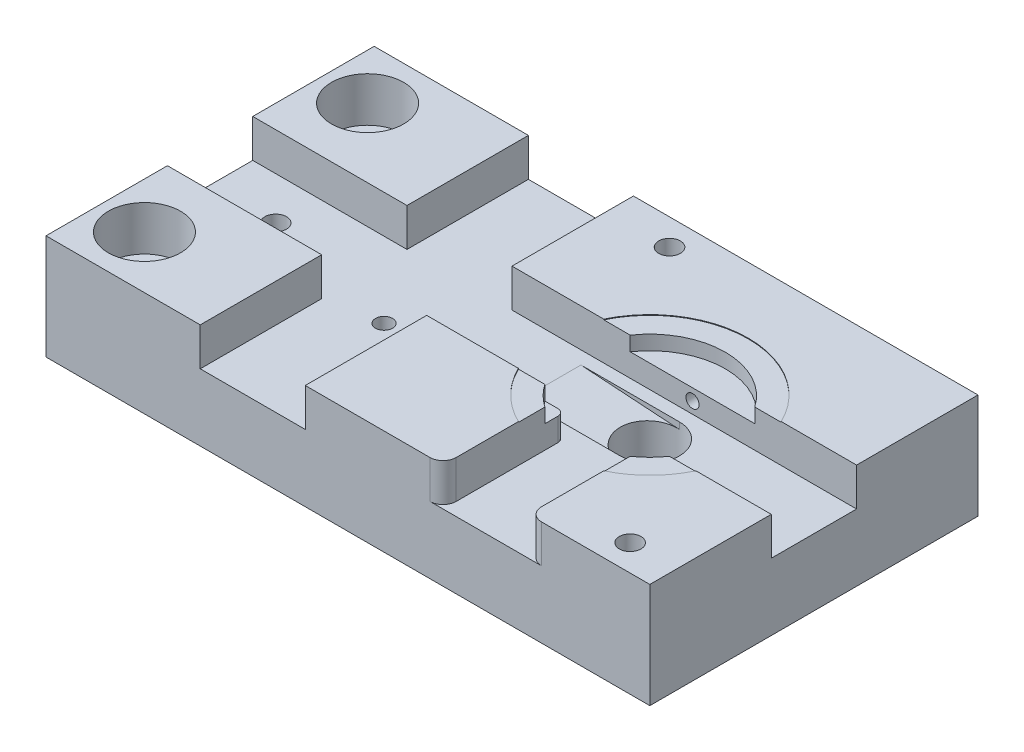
ISO-10303-21;
HEADER;
FILE_DESCRIPTION(('STEP AP214'),'2;1');
FILE_NAME('part.step','',(''),(''),'','','');
FILE_SCHEMA(('AUTOMOTIVE_DESIGN { 1 0 10303 214 1 1 1 1 }'));
ENDSEC;
DATA;
#1=APPLICATION_CONTEXT('core data for automotive mechanical design processes');
#2=APPLICATION_PROTOCOL_DEFINITION('international standard','automotive_design',2000,#1);
#3=PRODUCT_CONTEXT('',#1,'mechanical');
#4=PRODUCT('Part','Part','',(#3));
#5=PRODUCT_RELATED_PRODUCT_CATEGORY('part','',(#4));
#6=PRODUCT_DEFINITION_FORMATION('','',#4);
#7=PRODUCT_DEFINITION_CONTEXT('part definition',#1,'design');
#8=PRODUCT_DEFINITION('design','',#6,#7);
#9=PRODUCT_DEFINITION_SHAPE('','',#8);
#10=(LENGTH_UNIT() NAMED_UNIT(*) SI_UNIT(.MILLI.,.METRE.));
#11=(NAMED_UNIT(*) PLANE_ANGLE_UNIT() SI_UNIT($,.RADIAN.));
#12=(NAMED_UNIT(*) SI_UNIT($,.STERADIAN.) SOLID_ANGLE_UNIT());
#13=UNCERTAINTY_MEASURE_WITH_UNIT(LENGTH_MEASURE(1.E-05),#10,'distance_accuracy_value','');
#14=(GEOMETRIC_REPRESENTATION_CONTEXT(3) GLOBAL_UNCERTAINTY_ASSIGNED_CONTEXT((#13)) GLOBAL_UNIT_ASSIGNED_CONTEXT((#10,
#11,#12)) REPRESENTATION_CONTEXT('',''));
#15=CARTESIAN_POINT('',(0.,0.,0.));
#16=DIRECTION('',(0.,0.,1.));
#17=DIRECTION('',(1.,0.,0.));
#18=AXIS2_PLACEMENT_3D('',#15,#16,#17);
#19=CARTESIAN_POINT('',(21.,16.7,0.));
#20=DIRECTION('',(0.,1.,0.));
#21=DIRECTION('',(0.,0.,1.));
#22=AXIS2_PLACEMENT_3D('',#19,#20,#21);
#23=PLANE('',#22);
#24=DIRECTION('',(-1.,0.,0.));
#25=VECTOR('',#24,1.);
#26=CARTESIAN_POINT('',(-46.,16.7,6.5));
#27=LINE('',#26,#25);
#28=CARTESIAN_POINT('',(11.5131670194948,16.7,6.5));
#29=VERTEX_POINT('',#28);
#30=CARTESIAN_POINT('',(13.5,16.7,6.5));
#31=VERTEX_POINT('',#30);
#32=EDGE_CURVE('E260',#29,#31,#27,.F.);
#33=ORIENTED_EDGE('',*,*,#32,.F.);
#34=CARTESIAN_POINT('',(21.,16.7,0.));
#35=DIRECTION('',(0.,1.,0.));
#36=DIRECTION('',(0.,0.,1.));
#37=AXIS2_PLACEMENT_3D('',#34,#35,#36);
#38=CIRCLE('',#37,11.5);
#39=CARTESIAN_POINT('',(14.5,16.7,9.48683298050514));
#40=VERTEX_POINT('',#39);
#41=EDGE_CURVE('E481',#29,#40,#38,.T.);
#42=ORIENTED_EDGE('',*,*,#41,.T.);
#43=DIRECTION('',(0.,0.,-1.));
#44=VECTOR('',#43,1.);
#45=CARTESIAN_POINT('',(14.5,16.7,50.));
#46=LINE('',#45,#44);
#47=CARTESIAN_POINT('',(14.5,16.7,7.5));
#48=VERTEX_POINT('',#47);
#49=EDGE_CURVE('E275',#48,#40,#46,.F.);
#50=ORIENTED_EDGE('',*,*,#49,.F.);
#51=CARTESIAN_POINT('',(13.5,16.7,7.5));
#52=DIRECTION('',(0.,-1.,0.));
#53=DIRECTION('',(0.,0.,-1.));
#54=AXIS2_PLACEMENT_3D('',#51,#52,#53);
#55=CIRCLE('',#54,1.);
#56=EDGE_CURVE('E20',#31,#48,#55,.T.);
#57=ORIENTED_EDGE('',*,*,#56,.F.);
#58=EDGE_LOOP('',(#33,#42,#50,#57));
#59=FACE_BOUND('',#58,.T.);
#60=ADVANCED_FACE('F17',(#59),#23,.T.);
#61=CARTESIAN_POINT('',(13.5,25.,7.5));
#62=DIRECTION('',(0.,-1.,0.));
#63=DIRECTION('',(0.,0.,-1.));
#64=AXIS2_PLACEMENT_3D('',#61,#62,#63);
#65=CYLINDRICAL_SURFACE('',#64,1.);
#66=CARTESIAN_POINT('',(13.5,13.2,7.5));
#67=DIRECTION('',(0.,-1.,0.));
#68=DIRECTION('',(0.,0.,-1.));
#69=AXIS2_PLACEMENT_3D('',#66,#67,#68);
#70=CIRCLE('',#69,1.);
#71=CARTESIAN_POINT('',(14.5,13.2,7.5));
#72=VERTEX_POINT('',#71);
#73=CARTESIAN_POINT('',(13.5,13.2,6.5));
#74=VERTEX_POINT('',#73);
#75=EDGE_CURVE('E279',#72,#74,#70,.F.);
#76=ORIENTED_EDGE('',*,*,#75,.T.);
#77=DIRECTION('',(0.,1.,0.));
#78=VECTOR('',#77,1.);
#79=CARTESIAN_POINT('',(13.5,25.,6.5));
#80=LINE('',#79,#78);
#81=EDGE_CURVE('E265',#31,#74,#80,.F.);
#82=ORIENTED_EDGE('',*,*,#81,.F.);
#83=ORIENTED_EDGE('',*,*,#56,.T.);
#84=DIRECTION('',(0.,1.,0.));
#85=VECTOR('',#84,1.);
#86=CARTESIAN_POINT('',(14.5,25.,7.5));
#87=LINE('',#86,#85);
#88=EDGE_CURVE('E290',#72,#48,#87,.T.);
#89=ORIENTED_EDGE('',*,*,#88,.F.);
#90=EDGE_LOOP('',(#76,#82,#83,#89));
#91=FACE_BOUND('',#90,.T.);
#92=ADVANCED_FACE('F280',(#91),#65,.T.);
#93=CARTESIAN_POINT('',(21.,18.9,0.));
#94=DIRECTION('',(0.,1.,0.));
#95=DIRECTION('',(0.,0.,1.));
#96=AXIS2_PLACEMENT_3D('',#93,#94,#95);
#97=PLANE('',#96);
#98=CARTESIAN_POINT('',(21.,18.9,0.));
#99=DIRECTION('',(0.,1.,0.));
#100=DIRECTION('',(0.,0.,1.));
#101=AXIS2_PLACEMENT_3D('',#98,#99,#100);
#102=CIRCLE('',#101,11.5);
#103=CARTESIAN_POINT('',(14.5,18.9,9.48683298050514));
#104=VERTEX_POINT('',#103);
#105=CARTESIAN_POINT('',(11.5131670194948,18.9,6.5));
#106=VERTEX_POINT('',#105);
#107=EDGE_CURVE('E478',#104,#106,#102,.F.);
#108=ORIENTED_EDGE('',*,*,#107,.T.);
#109=DIRECTION('',(-1.,0.,0.));
#110=VECTOR('',#109,1.);
#111=CARTESIAN_POINT('',(-46.,18.9,6.5));
#112=LINE('',#111,#110);
#113=CARTESIAN_POINT('',(7.48149416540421,18.9,6.5));
#114=VERTEX_POINT('',#113);
#115=EDGE_CURVE('E284',#114,#106,#112,.F.);
#116=ORIENTED_EDGE('',*,*,#115,.F.);
#117=CARTESIAN_POINT('',(21.,18.9,0.));
#118=DIRECTION('',(0.,1.,0.));
#119=DIRECTION('',(0.,0.,1.));
#120=AXIS2_PLACEMENT_3D('',#117,#118,#119);
#121=CIRCLE('',#120,15.);
#122=CARTESIAN_POINT('',(14.5,18.9,13.5185058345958));
#123=VERTEX_POINT('',#122);
#124=EDGE_CURVE('E465',#114,#123,#121,.T.);
#125=ORIENTED_EDGE('',*,*,#124,.T.);
#126=DIRECTION('',(0.,0.,-1.));
#127=VECTOR('',#126,1.);
#128=CARTESIAN_POINT('',(14.5,18.9,50.));
#129=LINE('',#128,#127);
#130=EDGE_CURVE('E319',#104,#123,#129,.F.);
#131=ORIENTED_EDGE('',*,*,#130,.F.);
#132=EDGE_LOOP('',(#108,#116,#125,#131));
#133=FACE_BOUND('',#132,.T.);
#134=ADVANCED_FACE('F489',(#133),#97,.T.);
#135=CARTESIAN_POINT('',(21.,16.7,0.));
#136=DIRECTION('',(0.,1.,0.));
#137=DIRECTION('',(0.,0.,1.));
#138=AXIS2_PLACEMENT_3D('',#135,#136,#137);
#139=CYLINDRICAL_SURFACE('',#138,11.5);
#140=DIRECTION('',(0.,1.,0.));
#141=VECTOR('',#140,1.);
#142=CARTESIAN_POINT('',(14.5,25.,9.48683298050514));
#143=LINE('',#142,#141);
#144=EDGE_CURVE('E356',#40,#104,#143,.T.);
#145=ORIENTED_EDGE('',*,*,#144,.F.);
#146=ORIENTED_EDGE('',*,*,#41,.F.);
#147=DIRECTION('',(0.,1.,0.));
#148=VECTOR('',#147,1.);
#149=CARTESIAN_POINT('',(11.5131670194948,25.,6.5));
#150=LINE('',#149,#148);
#151=EDGE_CURVE('E268',#106,#29,#150,.F.);
#152=ORIENTED_EDGE('',*,*,#151,.F.);
#153=ORIENTED_EDGE('',*,*,#107,.F.);
#154=EDGE_LOOP('',(#145,#146,#152,#153));
#155=FACE_BOUND('',#154,.T.);
#156=ADVANCED_FACE('F484',(#155),#139,.F.);
#157=CARTESIAN_POINT('',(21.,16.7,0.));
#158=DIRECTION('',(0.,1.,0.));
#159=DIRECTION('',(0.,0.,1.));
#160=AXIS2_PLACEMENT_3D('',#157,#158,#159);
#161=PLANE('',#160);
#162=DIRECTION('',(0.,0.,1.));
#163=VECTOR('',#162,1.);
#164=CARTESIAN_POINT('',(27.5,16.7,50.));
#165=LINE('',#164,#163);
#166=CARTESIAN_POINT('',(27.5,16.7,9.48683298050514));
#167=VERTEX_POINT('',#166);
#168=CARTESIAN_POINT('',(27.5,16.7,6.5));
#169=VERTEX_POINT('',#168);
#170=EDGE_CURVE('E292',#167,#169,#165,.F.);
#171=ORIENTED_EDGE('',*,*,#170,.F.);
#172=CARTESIAN_POINT('',(21.,16.7,0.));
#173=DIRECTION('',(0.,1.,0.));
#174=DIRECTION('',(0.,0.,1.));
#175=AXIS2_PLACEMENT_3D('',#172,#173,#174);
#176=CIRCLE('',#175,11.5);
#177=CARTESIAN_POINT('',(30.4868329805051,16.7,6.5));
#178=VERTEX_POINT('',#177);
#179=EDGE_CURVE('E475',#167,#178,#176,.T.);
#180=ORIENTED_EDGE('',*,*,#179,.T.);
#181=DIRECTION('',(-1.,0.,0.));
#182=VECTOR('',#181,1.);
#183=CARTESIAN_POINT('',(-46.,16.7,6.5));
#184=LINE('',#183,#182);
#185=EDGE_CURVE('E305',#169,#178,#184,.F.);
#186=ORIENTED_EDGE('',*,*,#185,.F.);
#187=EDGE_LOOP('',(#171,#180,#186));
#188=FACE_BOUND('',#187,.T.);
#189=ADVANCED_FACE('F946',(#188),#161,.T.);
#190=CARTESIAN_POINT('',(21.,16.7,0.));
#191=DIRECTION('',(0.,1.,0.));
#192=DIRECTION('',(0.,0.,1.));
#193=AXIS2_PLACEMENT_3D('',#190,#191,#192);
#194=CYLINDRICAL_SURFACE('',#193,11.5);
#195=DIRECTION('',(0.,1.,0.));
#196=VECTOR('',#195,1.);
#197=CARTESIAN_POINT('',(30.4868329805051,25.,6.5));
#198=LINE('',#197,#196);
#199=CARTESIAN_POINT('',(30.4868329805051,18.9,6.5));
#200=VERTEX_POINT('',#199);
#201=EDGE_CURVE('E341',#178,#200,#198,.T.);
#202=ORIENTED_EDGE('',*,*,#201,.F.);
#203=ORIENTED_EDGE('',*,*,#179,.F.);
#204=DIRECTION('',(0.,1.,0.));
#205=VECTOR('',#204,1.);
#206=CARTESIAN_POINT('',(27.5,25.,9.48683298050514));
#207=LINE('',#206,#205);
#208=CARTESIAN_POINT('',(27.5,18.9,9.48683298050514));
#209=VERTEX_POINT('',#208);
#210=EDGE_CURVE('E349',#209,#167,#207,.F.);
#211=ORIENTED_EDGE('',*,*,#210,.F.);
#212=CARTESIAN_POINT('',(21.,18.9,0.));
#213=DIRECTION('',(0.,1.,0.));
#214=DIRECTION('',(0.,0.,1.));
#215=AXIS2_PLACEMENT_3D('',#212,#213,#214);
#216=CIRCLE('',#215,11.5);
#217=EDGE_CURVE('E473',#200,#209,#216,.F.);
#218=ORIENTED_EDGE('',*,*,#217,.F.);
#219=EDGE_LOOP('',(#202,#203,#211,#218));
#220=FACE_BOUND('',#219,.T.);
#221=ADVANCED_FACE('F943',(#220),#194,.F.);
#222=CARTESIAN_POINT('',(21.,18.9,0.));
#223=DIRECTION('',(0.,1.,0.));
#224=DIRECTION('',(0.,0.,1.));
#225=AXIS2_PLACEMENT_3D('',#222,#223,#224);
#226=PLANE('',#225);
#227=CARTESIAN_POINT('',(21.,18.9,0.));
#228=DIRECTION('',(0.,1.,0.));
#229=DIRECTION('',(0.,0.,1.));
#230=AXIS2_PLACEMENT_3D('',#227,#228,#229);
#231=CIRCLE('',#230,15.);
#232=CARTESIAN_POINT('',(27.5,18.9,13.5185058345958));
#233=VERTEX_POINT('',#232);
#234=CARTESIAN_POINT('',(34.5185058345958,18.9,6.5));
#235=VERTEX_POINT('',#234);
#236=EDGE_CURVE('E366',#233,#235,#231,.T.);
#237=ORIENTED_EDGE('',*,*,#236,.T.);
#238=DIRECTION('',(-1.,0.,0.));
#239=VECTOR('',#238,1.);
#240=CARTESIAN_POINT('',(-46.,18.9,6.5));
#241=LINE('',#240,#239);
#242=EDGE_CURVE('E313',#200,#235,#241,.F.);
#243=ORIENTED_EDGE('',*,*,#242,.F.);
#244=ORIENTED_EDGE('',*,*,#217,.T.);
#245=DIRECTION('',(0.,0.,1.));
#246=VECTOR('',#245,1.);
#247=CARTESIAN_POINT('',(27.5,18.9,50.));
#248=LINE('',#247,#246);
#249=EDGE_CURVE('E325',#233,#209,#248,.F.);
#250=ORIENTED_EDGE('',*,*,#249,.F.);
#251=EDGE_LOOP('',(#237,#243,#244,#250));
#252=FACE_BOUND('',#251,.T.);
#253=ADVANCED_FACE('F938',(#252),#226,.T.);
#254=CARTESIAN_POINT('',(21.,16.7,0.));
#255=DIRECTION('',(0.,1.,0.));
#256=DIRECTION('',(0.,0.,1.));
#257=AXIS2_PLACEMENT_3D('',#254,#255,#256);
#258=PLANE('',#257);
#259=CARTESIAN_POINT('',(21.,16.7,0.));
#260=DIRECTION('',(0.,1.,0.));
#261=DIRECTION('',(0.,0.,1.));
#262=AXIS2_PLACEMENT_3D('',#259,#260,#261);
#263=CIRCLE('',#262,11.5);
#264=CARTESIAN_POINT('',(30.4868329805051,16.7,-6.5));
#265=VERTEX_POINT('',#264);
#266=CARTESIAN_POINT('',(11.5131670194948,16.7,-6.5));
#267=VERTEX_POINT('',#266);
#268=EDGE_CURVE('E470',#265,#267,#263,.T.);
#269=ORIENTED_EDGE('',*,*,#268,.T.);
#270=DIRECTION('',(1.,0.,0.));
#271=VECTOR('',#270,1.);
#272=CARTESIAN_POINT('',(-46.,16.7,-6.5));
#273=LINE('',#272,#271);
#274=EDGE_CURVE('E334',#265,#267,#273,.F.);
#275=ORIENTED_EDGE('',*,*,#274,.F.);
#276=EDGE_LOOP('',(#269,#275));
#277=FACE_BOUND('',#276,.T.);
#278=ADVANCED_FACE('F1004',(#277),#258,.T.);
#279=CARTESIAN_POINT('',(21.,16.7,0.));
#280=DIRECTION('',(0.,1.,0.));
#281=DIRECTION('',(0.,0.,1.));
#282=AXIS2_PLACEMENT_3D('',#279,#280,#281);
#283=CYLINDRICAL_SURFACE('',#282,11.5);
#284=DIRECTION('',(0.,1.,0.));
#285=VECTOR('',#284,1.);
#286=CARTESIAN_POINT('',(11.5131670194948,25.,-6.5));
#287=LINE('',#286,#285);
#288=CARTESIAN_POINT('',(11.5131670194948,18.9,-6.5));
#289=VERTEX_POINT('',#288);
#290=EDGE_CURVE('E332',#267,#289,#287,.T.);
#291=ORIENTED_EDGE('',*,*,#290,.F.);
#292=ORIENTED_EDGE('',*,*,#268,.F.);
#293=DIRECTION('',(0.,1.,0.));
#294=VECTOR('',#293,1.);
#295=CARTESIAN_POINT('',(30.4868329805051,25.,-6.5));
#296=LINE('',#295,#294);
#297=CARTESIAN_POINT('',(30.4868329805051,18.9,-6.5));
#298=VERTEX_POINT('',#297);
#299=EDGE_CURVE('E336',#298,#265,#296,.F.);
#300=ORIENTED_EDGE('',*,*,#299,.F.);
#301=CARTESIAN_POINT('',(21.,18.9,0.));
#302=DIRECTION('',(0.,1.,0.));
#303=DIRECTION('',(0.,0.,1.));
#304=AXIS2_PLACEMENT_3D('',#301,#302,#303);
#305=CIRCLE('',#304,11.5);
#306=EDGE_CURVE('E367',#289,#298,#305,.F.);
#307=ORIENTED_EDGE('',*,*,#306,.F.);
#308=EDGE_LOOP('',(#291,#292,#300,#307));
#309=FACE_BOUND('',#308,.T.);
#310=ADVANCED_FACE('F1012',(#309),#283,.F.);
#311=CARTESIAN_POINT('',(21.,18.9,0.));
#312=DIRECTION('',(0.,1.,0.));
#313=DIRECTION('',(0.,0.,1.));
#314=AXIS2_PLACEMENT_3D('',#311,#312,#313);
#315=PLANE('',#314);
#316=ORIENTED_EDGE('',*,*,#306,.T.);
#317=DIRECTION('',(1.,0.,0.));
#318=VECTOR('',#317,1.);
#319=CARTESIAN_POINT('',(-46.,18.9,-6.5));
#320=LINE('',#319,#318);
#321=CARTESIAN_POINT('',(34.5185058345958,18.9,-6.5));
#322=VERTEX_POINT('',#321);
#323=EDGE_CURVE('E312',#322,#298,#320,.F.);
#324=ORIENTED_EDGE('',*,*,#323,.F.);
#325=CARTESIAN_POINT('',(21.,18.9,0.));
#326=DIRECTION('',(0.,1.,0.));
#327=DIRECTION('',(0.,0.,1.));
#328=AXIS2_PLACEMENT_3D('',#325,#326,#327);
#329=CIRCLE('',#328,15.);
#330=CARTESIAN_POINT('',(7.48149416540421,18.9,-6.5));
#331=VERTEX_POINT('',#330);
#332=EDGE_CURVE('E326',#322,#331,#329,.T.);
#333=ORIENTED_EDGE('',*,*,#332,.T.);
#334=DIRECTION('',(1.,0.,0.));
#335=VECTOR('',#334,1.);
#336=CARTESIAN_POINT('',(-46.,18.9,-6.5));
#337=LINE('',#336,#335);
#338=EDGE_CURVE('E316',#289,#331,#337,.F.);
#339=ORIENTED_EDGE('',*,*,#338,.F.);
#340=EDGE_LOOP('',(#316,#324,#333,#339));
#341=FACE_BOUND('',#340,.T.);
#342=ADVANCED_FACE('F1022',(#341),#315,.T.);
#343=CARTESIAN_POINT('',(21.,14.95,-25.));
#344=DIRECTION('',(0.,0.,1.));
#345=DIRECTION('',(1.,0.,0.));
#346=AXIS2_PLACEMENT_3D('',#343,#344,#345);
#347=CYLINDRICAL_SURFACE('',#346,1.);
#348=CARTESIAN_POINT('',(21.,14.95,-6.5));
#349=DIRECTION('',(0.,0.,1.));
#350=DIRECTION('',(1.,0.,0.));
#351=AXIS2_PLACEMENT_3D('',#348,#349,#350);
#352=CIRCLE('',#351,1.);
#353=CARTESIAN_POINT('',(22.,14.95,-6.5));
#354=VERTEX_POINT('',#353);
#355=EDGE_CURVE('E315',#354,#354,#352,.F.);
#356=ORIENTED_EDGE('',*,*,#355,.F.);
#357=EDGE_LOOP('',(#356));
#358=FACE_BOUND('',#357,.T.);
#359=CARTESIAN_POINT('',(21.,14.95,-16.3497848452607));
#360=DIRECTION('',(0.,0.,-1.));
#361=DIRECTION('',(-1.,0.,0.));
#362=AXIS2_PLACEMENT_3D('',#359,#360,#361);
#363=CIRCLE('',#362,0.99999999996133);
#364=CARTESIAN_POINT('',(20.0000000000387,14.95,-16.3497848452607));
#365=VERTEX_POINT('',#364);
#366=EDGE_CURVE('E364',#365,#365,#363,.T.);
#367=ORIENTED_EDGE('',*,*,#366,.T.);
#368=EDGE_LOOP('',(#367));
#369=FACE_BOUND('',#368,.T.);
#370=ADVANCED_FACE('F1032',(#358,#369),#347,.F.);
#371=CARTESIAN_POINT('',(21.,14.95,-16.5000000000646));
#372=DIRECTION('',(0.,0.,-1.));
#373=DIRECTION('',(-1.,0.,0.));
#374=AXIS2_PLACEMENT_3D('',#371,#372,#373);
#375=CONICAL_SURFACE('',#374,1.25000000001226,1.02974425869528);
#376=ORIENTED_EDGE('',*,*,#366,.F.);
#377=EDGE_LOOP('',(#376));
#378=FACE_BOUND('',#377,.T.);
#379=CARTESIAN_POINT('',(21.,14.95,-16.5));
#380=DIRECTION('',(0.,0.,-1.));
#381=DIRECTION('',(-1.,0.,0.));
#382=AXIS2_PLACEMENT_3D('',#379,#380,#381);
#383=CIRCLE('',#382,1.24999999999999);
#384=CARTESIAN_POINT('',(19.75,14.95,-16.5));
#385=VERTEX_POINT('',#384);
#386=EDGE_CURVE('E327',#385,#385,#383,.T.);
#387=ORIENTED_EDGE('',*,*,#386,.T.);
#388=EDGE_LOOP('',(#387));
#389=FACE_BOUND('',#388,.T.);
#390=ADVANCED_FACE('F1042',(#378,#389),#375,.F.);
#391=CARTESIAN_POINT('',(21.,18.9,0.));
#392=DIRECTION('',(0.,1.,0.));
#393=DIRECTION('',(0.,0.,1.));
#394=AXIS2_PLACEMENT_3D('',#391,#392,#393);
#395=CYLINDRICAL_SURFACE('',#394,15.);
#396=ORIENTED_EDGE('',*,*,#236,.F.);
#397=DIRECTION('',(0.,1.,0.));
#398=VECTOR('',#397,1.);
#399=CARTESIAN_POINT('',(27.5,25.,13.5185058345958));
#400=LINE('',#399,#398);
#401=CARTESIAN_POINT('',(27.5,19.,13.5185058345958));
#402=VERTEX_POINT('',#401);
#403=EDGE_CURVE('E322',#402,#233,#400,.F.);
#404=ORIENTED_EDGE('',*,*,#403,.F.);
#405=CARTESIAN_POINT('',(21.,19.,0.));
#406=DIRECTION('',(0.,1.,0.));
#407=DIRECTION('',(0.,0.,1.));
#408=AXIS2_PLACEMENT_3D('',#405,#406,#407);
#409=CIRCLE('',#408,15.);
#410=CARTESIAN_POINT('',(34.5185058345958,19.,6.5));
#411=VERTEX_POINT('',#410);
#412=EDGE_CURVE('E447',#411,#402,#409,.F.);
#413=ORIENTED_EDGE('',*,*,#412,.F.);
#414=DIRECTION('',(0.,1.,0.));
#415=VECTOR('',#414,1.);
#416=CARTESIAN_POINT('',(34.5185058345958,25.,6.5));
#417=LINE('',#416,#415);
#418=EDGE_CURVE('E306',#235,#411,#417,.T.);
#419=ORIENTED_EDGE('',*,*,#418,.F.);
#420=EDGE_LOOP('',(#396,#404,#413,#419));
#421=FACE_BOUND('',#420,.T.);
#422=ADVANCED_FACE('F933',(#421),#395,.F.);
#423=CARTESIAN_POINT('',(-39.,19.,17.));
#424=DIRECTION('',(0.,1.,0.));
#425=DIRECTION('',(0.,0.,1.));
#426=AXIS2_PLACEMENT_3D('',#423,#424,#425);
#427=CYLINDRICAL_SURFACE('',#426,5.49999999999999);
#428=CARTESIAN_POINT('',(-39.,19.,17.));
#429=DIRECTION('',(0.,1.,0.));
#430=DIRECTION('',(0.,0.,1.));
#431=AXIS2_PLACEMENT_3D('',#428,#429,#430);
#432=CIRCLE('',#431,5.49999999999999);
#433=CARTESIAN_POINT('',(-39.,19.,22.5));
#434=VERTEX_POINT('',#433);
#435=EDGE_CURVE('E442',#434,#434,#432,.F.);
#436=ORIENTED_EDGE('',*,*,#435,.F.);
#437=EDGE_LOOP('',(#436));
#438=FACE_BOUND('',#437,.T.);
#439=CARTESIAN_POINT('',(-39.,12.2,17.));
#440=DIRECTION('',(0.,1.,0.));
#441=DIRECTION('',(0.,0.,1.));
#442=AXIS2_PLACEMENT_3D('',#439,#440,#441);
#443=CIRCLE('',#442,5.49999999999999);
#444=CARTESIAN_POINT('',(-39.,12.2,22.5));
#445=VERTEX_POINT('',#444);
#446=EDGE_CURVE('E321',#445,#445,#443,.F.);
#447=ORIENTED_EDGE('',*,*,#446,.T.);
#448=EDGE_LOOP('',(#447));
#449=FACE_BOUND('',#448,.T.);
#450=ADVANCED_FACE('F1061',(#438,#449),#427,.F.);
#451=CARTESIAN_POINT('',(21.,18.9,0.));
#452=DIRECTION('',(0.,1.,0.));
#453=DIRECTION('',(0.,0.,1.));
#454=AXIS2_PLACEMENT_3D('',#451,#452,#453);
#455=CYLINDRICAL_SURFACE('',#454,15.);
#456=CARTESIAN_POINT('',(21.,19.,0.));
#457=DIRECTION('',(0.,1.,0.));
#458=DIRECTION('',(0.,0.,1.));
#459=AXIS2_PLACEMENT_3D('',#456,#457,#458);
#460=CIRCLE('',#459,15.);
#461=CARTESIAN_POINT('',(14.5,19.,13.5185058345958));
#462=VERTEX_POINT('',#461);
#463=CARTESIAN_POINT('',(7.48149416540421,19.,6.5));
#464=VERTEX_POINT('',#463);
#465=EDGE_CURVE('E438',#462,#464,#460,.F.);
#466=ORIENTED_EDGE('',*,*,#465,.F.);
#467=DIRECTION('',(0.,1.,0.));
#468=VECTOR('',#467,1.);
#469=CARTESIAN_POINT('',(14.5,25.,13.5185058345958));
#470=LINE('',#469,#468);
#471=EDGE_CURVE('E271',#123,#462,#470,.T.);
#472=ORIENTED_EDGE('',*,*,#471,.F.);
#473=ORIENTED_EDGE('',*,*,#124,.F.);
#474=DIRECTION('',(0.,1.,0.));
#475=VECTOR('',#474,1.);
#476=CARTESIAN_POINT('',(7.48149416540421,25.,6.5));
#477=LINE('',#476,#475);
#478=EDGE_CURVE('E281',#464,#114,#477,.F.);
#479=ORIENTED_EDGE('',*,*,#478,.F.);
#480=EDGE_LOOP('',(#466,#472,#473,#479));
#481=FACE_BOUND('',#480,.T.);
#482=ADVANCED_FACE('F495',(#481),#455,.F.);
#483=CARTESIAN_POINT('',(21.,18.9,0.));
#484=DIRECTION('',(0.,1.,0.));
#485=DIRECTION('',(0.,0.,1.));
#486=AXIS2_PLACEMENT_3D('',#483,#484,#485);
#487=CYLINDRICAL_SURFACE('',#486,15.);
#488=CARTESIAN_POINT('',(21.,19.,0.));
#489=DIRECTION('',(0.,1.,0.));
#490=DIRECTION('',(0.,0.,1.));
#491=AXIS2_PLACEMENT_3D('',#488,#489,#490);
#492=CIRCLE('',#491,15.);
#493=CARTESIAN_POINT('',(7.48149416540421,19.,-6.5));
#494=VERTEX_POINT('',#493);
#495=CARTESIAN_POINT('',(34.5185058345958,19.,-6.5));
#496=VERTEX_POINT('',#495);
#497=EDGE_CURVE('E433',#494,#496,#492,.F.);
#498=ORIENTED_EDGE('',*,*,#497,.F.);
#499=DIRECTION('',(0.,1.,0.));
#500=VECTOR('',#499,1.);
#501=CARTESIAN_POINT('',(7.48149416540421,25.,-6.5));
#502=LINE('',#501,#500);
#503=EDGE_CURVE('E314',#331,#494,#502,.T.);
#504=ORIENTED_EDGE('',*,*,#503,.F.);
#505=ORIENTED_EDGE('',*,*,#332,.F.);
#506=DIRECTION('',(0.,1.,0.));
#507=VECTOR('',#506,1.);
#508=CARTESIAN_POINT('',(34.5185058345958,25.,-6.5));
#509=LINE('',#508,#507);
#510=EDGE_CURVE('E309',#496,#322,#509,.F.);
#511=ORIENTED_EDGE('',*,*,#510,.F.);
#512=EDGE_LOOP('',(#498,#504,#505,#511));
#513=FACE_BOUND('',#512,.T.);
#514=ADVANCED_FACE('F898',(#513),#487,.F.);
#515=CARTESIAN_POINT('',(-39.,19.,-17.));
#516=DIRECTION('',(0.,1.,0.));
#517=DIRECTION('',(0.,0.,1.));
#518=AXIS2_PLACEMENT_3D('',#515,#516,#517);
#519=CYLINDRICAL_SURFACE('',#518,5.49999999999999);
#520=CARTESIAN_POINT('',(-39.,12.2,-17.));
#521=DIRECTION('',(0.,1.,0.));
#522=DIRECTION('',(0.,0.,1.));
#523=AXIS2_PLACEMENT_3D('',#520,#521,#522);
#524=CIRCLE('',#523,5.49999999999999);
#525=CARTESIAN_POINT('',(-39.,12.2,-11.5));
#526=VERTEX_POINT('',#525);
#527=EDGE_CURVE('E428',#526,#526,#524,.F.);
#528=ORIENTED_EDGE('',*,*,#527,.T.);
#529=EDGE_LOOP('',(#528));
#530=FACE_BOUND('',#529,.T.);
#531=CARTESIAN_POINT('',(-39.,19.,-17.));
#532=DIRECTION('',(0.,1.,0.));
#533=DIRECTION('',(0.,0.,1.));
#534=AXIS2_PLACEMENT_3D('',#531,#532,#533);
#535=CIRCLE('',#534,5.49999999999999);
#536=CARTESIAN_POINT('',(-39.,19.,-11.5));
#537=VERTEX_POINT('',#536);
#538=EDGE_CURVE('E453',#537,#537,#535,.F.);
#539=ORIENTED_EDGE('',*,*,#538,.F.);
#540=EDGE_LOOP('',(#539));
#541=FACE_BOUND('',#540,.T.);
#542=ADVANCED_FACE('F894',(#530,#541),#519,.F.);
#543=CARTESIAN_POINT('',(27.5,25.,50.));
#544=DIRECTION('',(-1.,0.,0.));
#545=DIRECTION('',(0.,0.,1.));
#546=AXIS2_PLACEMENT_3D('',#543,#544,#545);
#547=PLANE('',#546);
#548=ORIENTED_EDGE('',*,*,#170,.T.);
#549=DIRECTION('',(0.,1.,0.));
#550=VECTOR('',#549,1.);
#551=CARTESIAN_POINT('',(27.5,25.,6.5));
#552=LINE('',#551,#550);
#553=CARTESIAN_POINT('',(27.5,13.2,6.5));
#554=VERTEX_POINT('',#553);
#555=EDGE_CURVE('E302',#554,#169,#552,.T.);
#556=ORIENTED_EDGE('',*,*,#555,.F.);
#557=DIRECTION('',(0.,0.,-1.));
#558=VECTOR('',#557,1.);
#559=CARTESIAN_POINT('',(27.5,13.2,0.));
#560=LINE('',#559,#558);
#561=CARTESIAN_POINT('',(27.5,13.2,23.));
#562=VERTEX_POINT('',#561);
#563=EDGE_CURVE('E427',#554,#562,#560,.F.);
#564=ORIENTED_EDGE('',*,*,#563,.T.);
#565=DIRECTION('',(0.,-1.,0.));
#566=VECTOR('',#565,1.);
#567=CARTESIAN_POINT('',(27.5,25.,23.));
#568=LINE('',#567,#566);
#569=CARTESIAN_POINT('',(27.5,19.,23.));
#570=VERTEX_POINT('',#569);
#571=EDGE_CURVE('E298',#570,#562,#568,.T.);
#572=ORIENTED_EDGE('',*,*,#571,.F.);
#573=DIRECTION('',(0.,0.,1.));
#574=VECTOR('',#573,1.);
#575=CARTESIAN_POINT('',(27.5,19.,0.));
#576=LINE('',#575,#574);
#577=EDGE_CURVE('E300',#402,#570,#576,.T.);
#578=ORIENTED_EDGE('',*,*,#577,.F.);
#579=ORIENTED_EDGE('',*,*,#403,.T.);
#580=ORIENTED_EDGE('',*,*,#249,.T.);
#581=ORIENTED_EDGE('',*,*,#210,.T.);
#582=EDGE_LOOP('',(#548,#556,#564,#572,#578,#579,#580,#581));
#583=FACE_BOUND('',#582,.T.);
#584=ADVANCED_FACE('F897',(#583),#547,.T.);
#585=CARTESIAN_POINT('',(14.5,25.,50.));
#586=DIRECTION('',(1.,0.,0.));
#587=DIRECTION('',(0.,0.,-1.));
#588=AXIS2_PLACEMENT_3D('',#585,#586,#587);
#589=PLANE('',#588);
#590=DIRECTION('',(0.,0.,1.));
#591=VECTOR('',#590,1.);
#592=CARTESIAN_POINT('',(14.5,19.,0.));
#593=LINE('',#592,#591);
#594=CARTESIAN_POINT('',(14.5,19.,23.));
#595=VERTEX_POINT('',#594);
#596=EDGE_CURVE('E441',#595,#462,#593,.F.);
#597=ORIENTED_EDGE('',*,*,#596,.F.);
#598=DIRECTION('',(0.,1.,0.));
#599=VECTOR('',#598,1.);
#600=CARTESIAN_POINT('',(14.5,25.,23.));
#601=LINE('',#600,#599);
#602=CARTESIAN_POINT('',(14.5,13.2,23.));
#603=VERTEX_POINT('',#602);
#604=EDGE_CURVE('E293',#603,#595,#601,.T.);
#605=ORIENTED_EDGE('',*,*,#604,.F.);
#606=DIRECTION('',(0.,0.,-1.));
#607=VECTOR('',#606,1.);
#608=CARTESIAN_POINT('',(14.5,13.2,0.));
#609=LINE('',#608,#607);
#610=EDGE_CURVE('E423',#603,#72,#609,.T.);
#611=ORIENTED_EDGE('',*,*,#610,.T.);
#612=ORIENTED_EDGE('',*,*,#88,.T.);
#613=ORIENTED_EDGE('',*,*,#49,.T.);
#614=ORIENTED_EDGE('',*,*,#144,.T.);
#615=ORIENTED_EDGE('',*,*,#130,.T.);
#616=ORIENTED_EDGE('',*,*,#471,.T.);
#617=EDGE_LOOP('',(#597,#605,#611,#612,#613,#614,#615,#616));
#618=FACE_BOUND('',#617,.T.);
#619=ADVANCED_FACE('F487',(#618),#589,.T.);
#620=CARTESIAN_POINT('',(-46.,25.,6.5));
#621=DIRECTION('',(0.,0.,-1.));
#622=DIRECTION('',(-1.,0.,0.));
#623=AXIS2_PLACEMENT_3D('',#620,#621,#622);
#624=PLANE('',#623);
#625=ORIENTED_EDGE('',*,*,#115,.T.);
#626=ORIENTED_EDGE('',*,*,#151,.T.);
#627=ORIENTED_EDGE('',*,*,#32,.T.);
#628=ORIENTED_EDGE('',*,*,#81,.T.);
#629=DIRECTION('',(1.,0.,0.));
#630=VECTOR('',#629,1.);
#631=CARTESIAN_POINT('',(0.,13.2,6.5));
#632=LINE('',#631,#630);
#633=CARTESIAN_POINT('',(-6.49999999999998,13.2,6.5));
#634=VERTEX_POINT('',#633);
#635=EDGE_CURVE('E527',#74,#634,#632,.F.);
#636=ORIENTED_EDGE('',*,*,#635,.T.);
#637=DIRECTION('',(0.,1.,0.));
#638=VECTOR('',#637,1.);
#639=CARTESIAN_POINT('',(-6.49999999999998,-39.2976189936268,6.5));
#640=LINE('',#639,#638);
#641=CARTESIAN_POINT('',(-6.49999999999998,19.,6.5));
#642=VERTEX_POINT('',#641);
#643=EDGE_CURVE('E501',#634,#642,#640,.T.);
#644=ORIENTED_EDGE('',*,*,#643,.T.);
#645=DIRECTION('',(1.,0.,0.));
#646=VECTOR('',#645,1.);
#647=CARTESIAN_POINT('',(21.,19.,6.5));
#648=LINE('',#647,#646);
#649=EDGE_CURVE('E440',#464,#642,#648,.F.);
#650=ORIENTED_EDGE('',*,*,#649,.F.);
#651=ORIENTED_EDGE('',*,*,#478,.T.);
#652=EDGE_LOOP('',(#625,#626,#627,#628,#636,#644,#650,#651));
#653=FACE_BOUND('',#652,.T.);
#654=ADVANCED_FACE('F262',(#653),#624,.T.);
#655=CARTESIAN_POINT('',(0.,0.,-4.5));
#656=DIRECTION('',(0.,0.,1.));
#657=DIRECTION('',(1.,0.,0.));
#658=AXIS2_PLACEMENT_3D('',#655,#656,#657);
#659=PLANE('',#658);
#660=DIRECTION('',(1.,0.,0.));
#661=VECTOR('',#660,1.);
#662=CARTESIAN_POINT('',(0.,13.2,-4.5));
#663=LINE('',#662,#661);
#664=CARTESIAN_POINT('',(21.,13.2,-4.5));
#665=VERTEX_POINT('',#664);
#666=CARTESIAN_POINT('',(5.99999999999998,13.2,-4.50000000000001));
#667=VERTEX_POINT('',#666);
#668=EDGE_CURVE('E431',#665,#667,#663,.F.);
#669=ORIENTED_EDGE('',*,*,#668,.T.);
#670=DIRECTION('',(-0.997785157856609,0.066519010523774,0.));
#671=VECTOR('',#670,1.);
#672=CARTESIAN_POINT('',(21.,12.2,-4.50000000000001));
#673=LINE('',#672,#671);
#674=CARTESIAN_POINT('',(21.,12.2,-4.5));
#675=VERTEX_POINT('',#674);
#676=EDGE_CURVE('E692',#675,#667,#673,.T.);
#677=ORIENTED_EDGE('',*,*,#676,.F.);
#678=DIRECTION('',(0.,1.,0.));
#679=VECTOR('',#678,1.);
#680=CARTESIAN_POINT('',(21.,0.,-4.5));
#681=LINE('',#680,#679);
#682=EDGE_CURVE('E353',#675,#665,#681,.T.);
#683=ORIENTED_EDGE('',*,*,#682,.T.);
#684=EDGE_LOOP('',(#669,#677,#683));
#685=FACE_BOUND('',#684,.T.);
#686=ADVANCED_FACE('F1118',(#685),#659,.T.);
#687=CARTESIAN_POINT('',(0.,0.,4.5));
#688=DIRECTION('',(0.,0.,1.));
#689=DIRECTION('',(1.,0.,0.));
#690=AXIS2_PLACEMENT_3D('',#687,#688,#689);
#691=PLANE('',#690);
#692=DIRECTION('',(-0.997785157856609,0.066519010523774,0.));
#693=VECTOR('',#692,1.);
#694=CARTESIAN_POINT('',(21.,12.2,4.5));
#695=LINE('',#694,#693);
#696=CARTESIAN_POINT('',(5.99999999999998,13.2,4.5));
#697=VERTEX_POINT('',#696);
#698=CARTESIAN_POINT('',(21.,12.2,4.5));
#699=VERTEX_POINT('',#698);
#700=EDGE_CURVE('E419',#697,#699,#695,.F.);
#701=ORIENTED_EDGE('',*,*,#700,.F.);
#702=DIRECTION('',(1.,0.,0.));
#703=VECTOR('',#702,1.);
#704=CARTESIAN_POINT('',(0.,13.2,4.5));
#705=LINE('',#704,#703);
#706=CARTESIAN_POINT('',(21.,13.2,4.5));
#707=VERTEX_POINT('',#706);
#708=EDGE_CURVE('E698',#697,#707,#705,.T.);
#709=ORIENTED_EDGE('',*,*,#708,.T.);
#710=DIRECTION('',(0.,1.,0.));
#711=VECTOR('',#710,1.);
#712=CARTESIAN_POINT('',(21.,0.,4.5));
#713=LINE('',#712,#711);
#714=EDGE_CURVE('E462',#699,#707,#713,.T.);
#715=ORIENTED_EDGE('',*,*,#714,.F.);
#716=EDGE_LOOP('',(#701,#709,#715));
#717=FACE_BOUND('',#716,.T.);
#718=ADVANCED_FACE('F1127',(#717),#691,.F.);
#719=CARTESIAN_POINT('',(-35.8,12.2,17.));
#720=DIRECTION('',(0.,-1.,0.));
#721=DIRECTION('',(0.,0.,-1.));
#722=AXIS2_PLACEMENT_3D('',#719,#720,#721);
#723=PLANE('',#722);
#724=ORIENTED_EDGE('',*,*,#446,.F.);
#725=EDGE_LOOP('',(#724));
#726=FACE_BOUND('',#725,.T.);
#727=CARTESIAN_POINT('',(-39.,12.2,17.));
#728=DIRECTION('',(0.,1.,0.));
#729=DIRECTION('',(0.,0.,1.));
#730=AXIS2_PLACEMENT_3D('',#727,#728,#729);
#731=CIRCLE('',#730,3.2);
#732=CARTESIAN_POINT('',(-39.,12.2,20.2));
#733=VERTEX_POINT('',#732);
#734=EDGE_CURVE('E413',#733,#733,#731,.F.);
#735=ORIENTED_EDGE('',*,*,#734,.T.);
#736=EDGE_LOOP('',(#735));
#737=FACE_BOUND('',#736,.T.);
#738=ADVANCED_FACE('F1137',(#726,#737),#723,.F.);
#739=CARTESIAN_POINT('',(-46.,25.,6.5));
#740=DIRECTION('',(0.,0.,-1.));
#741=DIRECTION('',(-1.,0.,0.));
#742=AXIS2_PLACEMENT_3D('',#739,#740,#741);
#743=PLANE('',#742);
#744=ORIENTED_EDGE('',*,*,#201,.T.);
#745=ORIENTED_EDGE('',*,*,#242,.T.);
#746=ORIENTED_EDGE('',*,*,#418,.T.);
#747=DIRECTION('',(1.,0.,0.));
#748=VECTOR('',#747,1.);
#749=CARTESIAN_POINT('',(21.,19.,6.5));
#750=LINE('',#749,#748);
#751=CARTESIAN_POINT('',(46.,19.,6.5));
#752=VERTEX_POINT('',#751);
#753=EDGE_CURVE('E450',#752,#411,#750,.F.);
#754=ORIENTED_EDGE('',*,*,#753,.F.);
#755=DIRECTION('',(0.,1.,0.));
#756=VECTOR('',#755,1.);
#757=CARTESIAN_POINT('',(46.,25.,6.5));
#758=LINE('',#757,#756);
#759=CARTESIAN_POINT('',(46.,13.2,6.5));
#760=VERTEX_POINT('',#759);
#761=EDGE_CURVE('E584',#752,#760,#758,.F.);
#762=ORIENTED_EDGE('',*,*,#761,.T.);
#763=DIRECTION('',(1.,0.,0.));
#764=VECTOR('',#763,1.);
#765=CARTESIAN_POINT('',(0.,13.2,6.5));
#766=LINE('',#765,#764);
#767=EDGE_CURVE('E695',#760,#554,#766,.F.);
#768=ORIENTED_EDGE('',*,*,#767,.T.);
#769=ORIENTED_EDGE('',*,*,#555,.T.);
#770=ORIENTED_EDGE('',*,*,#185,.T.);
#771=EDGE_LOOP('',(#744,#745,#746,#754,#762,#768,#769,#770));
#772=FACE_BOUND('',#771,.T.);
#773=ADVANCED_FACE('F928',(#772),#743,.T.);
#774=CARTESIAN_POINT('',(-46.,25.,-6.5));
#775=DIRECTION('',(0.,0.,1.));
#776=DIRECTION('',(1.,0.,0.));
#777=AXIS2_PLACEMENT_3D('',#774,#775,#776);
#778=PLANE('',#777);
#779=ORIENTED_EDGE('',*,*,#355,.T.);
#780=EDGE_LOOP('',(#779));
#781=FACE_BOUND('',#780,.T.);
#782=ORIENTED_EDGE('',*,*,#503,.T.);
#783=DIRECTION('',(1.,0.,0.));
#784=VECTOR('',#783,1.);
#785=CARTESIAN_POINT('',(21.,19.,-6.5));
#786=LINE('',#785,#784);
#787=CARTESIAN_POINT('',(-6.49999999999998,19.,-6.5));
#788=VERTEX_POINT('',#787);
#789=EDGE_CURVE('E435',#788,#494,#786,.T.);
#790=ORIENTED_EDGE('',*,*,#789,.F.);
#791=DIRECTION('',(0.,1.,0.));
#792=VECTOR('',#791,1.);
#793=CARTESIAN_POINT('',(-6.49999999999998,-39.2976189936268,-6.5));
#794=LINE('',#793,#792);
#795=CARTESIAN_POINT('',(-6.49999999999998,13.2,-6.5));
#796=VERTEX_POINT('',#795);
#797=EDGE_CURVE('E330',#788,#796,#794,.F.);
#798=ORIENTED_EDGE('',*,*,#797,.T.);
#799=DIRECTION('',(1.,0.,0.));
#800=VECTOR('',#799,1.);
#801=CARTESIAN_POINT('',(0.,13.2,-6.5));
#802=LINE('',#801,#800);
#803=CARTESIAN_POINT('',(46.,13.2,-6.5));
#804=VERTEX_POINT('',#803);
#805=EDGE_CURVE('E650',#796,#804,#802,.T.);
#806=ORIENTED_EDGE('',*,*,#805,.T.);
#807=DIRECTION('',(0.,1.,0.));
#808=VECTOR('',#807,1.);
#809=CARTESIAN_POINT('',(46.,25.,-6.5));
#810=LINE('',#809,#808);
#811=CARTESIAN_POINT('',(46.,19.,-6.5));
#812=VERTEX_POINT('',#811);
#813=EDGE_CURVE('E671',#804,#812,#810,.T.);
#814=ORIENTED_EDGE('',*,*,#813,.T.);
#815=DIRECTION('',(1.,0.,0.));
#816=VECTOR('',#815,1.);
#817=CARTESIAN_POINT('',(21.,19.,-6.5));
#818=LINE('',#817,#816);
#819=EDGE_CURVE('E432',#496,#812,#818,.T.);
#820=ORIENTED_EDGE('',*,*,#819,.F.);
#821=ORIENTED_EDGE('',*,*,#510,.T.);
#822=ORIENTED_EDGE('',*,*,#323,.T.);
#823=ORIENTED_EDGE('',*,*,#299,.T.);
#824=ORIENTED_EDGE('',*,*,#274,.T.);
#825=ORIENTED_EDGE('',*,*,#290,.T.);
#826=ORIENTED_EDGE('',*,*,#338,.T.);
#827=EDGE_LOOP('',(#782,#790,#798,#806,#814,#820,#821,#822,#823,#824,#825,#826));
#828=FACE_BOUND('',#827,.T.);
#829=ADVANCED_FACE('F924',(#781,#828),#778,.T.);
#830=CARTESIAN_POINT('',(21.,14.95,-25.));
#831=DIRECTION('',(0.,0.,-1.));
#832=DIRECTION('',(-1.,0.,0.));
#833=AXIS2_PLACEMENT_3D('',#830,#831,#832);
#834=CYLINDRICAL_SURFACE('',#833,1.24999999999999);
#835=ORIENTED_EDGE('',*,*,#386,.F.);
#836=EDGE_LOOP('',(#835));
#837=FACE_BOUND('',#836,.T.);
#838=CARTESIAN_POINT('',(21.,14.95,-25.));
#839=DIRECTION('',(0.,0.,-1.));
#840=DIRECTION('',(-1.,0.,0.));
#841=AXIS2_PLACEMENT_3D('',#838,#839,#840);
#842=CIRCLE('',#841,1.24999999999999);
#843=CARTESIAN_POINT('',(19.75,14.95,-25.));
#844=VERTEX_POINT('',#843);
#845=EDGE_CURVE('E401',#844,#844,#842,.T.);
#846=ORIENTED_EDGE('',*,*,#845,.T.);
#847=EDGE_LOOP('',(#846));
#848=FACE_BOUND('',#847,.T.);
#849=ADVANCED_FACE('F1164',(#837,#848),#834,.F.);
#850=CARTESIAN_POINT('',(-6.49999999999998,-39.2976189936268,-25.));
#851=DIRECTION('',(1.,0.,0.));
#852=DIRECTION('',(0.,0.,-1.));
#853=AXIS2_PLACEMENT_3D('',#850,#851,#852);
#854=PLANE('',#853);
#855=DIRECTION('',(0.,0.,1.));
#856=VECTOR('',#855,1.);
#857=CARTESIAN_POINT('',(-6.49999999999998,19.,0.));
#858=LINE('',#857,#856);
#859=CARTESIAN_POINT('',(-6.49999999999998,19.,-25.));
#860=VERTEX_POINT('',#859);
#861=EDGE_CURVE('E296',#860,#788,#858,.T.);
#862=ORIENTED_EDGE('',*,*,#861,.F.);
#863=DIRECTION('',(0.,1.,0.));
#864=VECTOR('',#863,1.);
#865=CARTESIAN_POINT('',(-6.49999999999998,25.,-25.));
#866=LINE('',#865,#864);
#867=CARTESIAN_POINT('',(-6.49999999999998,13.2,-25.));
#868=VERTEX_POINT('',#867);
#869=EDGE_CURVE('E641',#860,#868,#866,.F.);
#870=ORIENTED_EDGE('',*,*,#869,.T.);
#871=DIRECTION('',(0.,0.,-1.));
#872=VECTOR('',#871,1.);
#873=CARTESIAN_POINT('',(-6.49999999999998,13.2,0.));
#874=LINE('',#873,#872);
#875=EDGE_CURVE('E645',#868,#796,#874,.F.);
#876=ORIENTED_EDGE('',*,*,#875,.T.);
#877=ORIENTED_EDGE('',*,*,#797,.F.);
#878=EDGE_LOOP('',(#862,#870,#876,#877));
#879=FACE_BOUND('',#878,.T.);
#880=ADVANCED_FACE('F917',(#879),#854,.F.);
#881=CARTESIAN_POINT('',(-22.5,-39.2976189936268,-25.));
#882=DIRECTION('',(-1.,0.,0.));
#883=DIRECTION('',(0.,0.,1.));
#884=AXIS2_PLACEMENT_3D('',#881,#882,#883);
#885=PLANE('',#884);
#886=DIRECTION('',(0.,0.,-1.));
#887=VECTOR('',#886,1.);
#888=CARTESIAN_POINT('',(-22.5,13.2,0.));
#889=LINE('',#888,#887);
#890=CARTESIAN_POINT('',(-22.5,13.2,-6.5));
#891=VERTEX_POINT('',#890);
#892=CARTESIAN_POINT('',(-22.5,13.2,-25.));
#893=VERTEX_POINT('',#892);
#894=EDGE_CURVE('E606',#891,#893,#889,.T.);
#895=ORIENTED_EDGE('',*,*,#894,.T.);
#896=DIRECTION('',(0.,1.,0.));
#897=VECTOR('',#896,1.);
#898=CARTESIAN_POINT('',(-22.5,25.,-25.));
#899=LINE('',#898,#897);
#900=CARTESIAN_POINT('',(-22.5,19.,-25.));
#901=VERTEX_POINT('',#900);
#902=EDGE_CURVE('E624',#893,#901,#899,.T.);
#903=ORIENTED_EDGE('',*,*,#902,.T.);
#904=DIRECTION('',(0.,0.,1.));
#905=VECTOR('',#904,1.);
#906=CARTESIAN_POINT('',(-22.5,19.,0.));
#907=LINE('',#906,#905);
#908=CARTESIAN_POINT('',(-22.5,19.,-6.5));
#909=VERTEX_POINT('',#908);
#910=EDGE_CURVE('E457',#909,#901,#907,.F.);
#911=ORIENTED_EDGE('',*,*,#910,.F.);
#912=DIRECTION('',(0.,1.,0.));
#913=VECTOR('',#912,1.);
#914=CARTESIAN_POINT('',(-22.5,25.,-6.5));
#915=LINE('',#914,#913);
#916=EDGE_CURVE('E456',#891,#909,#915,.T.);
#917=ORIENTED_EDGE('',*,*,#916,.F.);
#918=EDGE_LOOP('',(#895,#903,#911,#917));
#919=FACE_BOUND('',#918,.T.);
#920=ADVANCED_FACE('F906',(#919),#885,.F.);
#921=CARTESIAN_POINT('',(21.,19.,0.));
#922=DIRECTION('',(0.,1.,0.));
#923=DIRECTION('',(0.,0.,1.));
#924=AXIS2_PLACEMENT_3D('',#921,#922,#923);
#925=PLANE('',#924);
#926=ORIENTED_EDGE('',*,*,#538,.T.);
#927=EDGE_LOOP('',(#926));
#928=FACE_BOUND('',#927,.T.);
#929=DIRECTION('',(0.,0.,-1.));
#930=VECTOR('',#929,1.);
#931=CARTESIAN_POINT('',(-46.,19.,-25.));
#932=LINE('',#931,#930);
#933=CARTESIAN_POINT('',(-46.,19.,-25.));
#934=VERTEX_POINT('',#933);
#935=CARTESIAN_POINT('',(-46.,19.,-6.5));
#936=VERTEX_POINT('',#935);
#937=EDGE_CURVE('E611',#934,#936,#932,.F.);
#938=ORIENTED_EDGE('',*,*,#937,.T.);
#939=DIRECTION('',(1.,0.,0.));
#940=VECTOR('',#939,1.);
#941=CARTESIAN_POINT('',(-46.,19.,-6.5));
#942=LINE('',#941,#940);
#943=EDGE_CURVE('E301',#909,#936,#942,.F.);
#944=ORIENTED_EDGE('',*,*,#943,.F.);
#945=ORIENTED_EDGE('',*,*,#910,.T.);
#946=DIRECTION('',(1.,0.,0.));
#947=VECTOR('',#946,1.);
#948=CARTESIAN_POINT('',(-46.,19.,-25.));
#949=LINE('',#948,#947);
#950=EDGE_CURVE('E619',#901,#934,#949,.F.);
#951=ORIENTED_EDGE('',*,*,#950,.T.);
#952=EDGE_LOOP('',(#938,#944,#945,#951));
#953=FACE_BOUND('',#952,.T.);
#954=ADVANCED_FACE('F902',(#928,#953),#925,.T.);
#955=CARTESIAN_POINT('',(-46.,25.,-6.5));
#956=DIRECTION('',(0.,0.,1.));
#957=DIRECTION('',(1.,0.,0.));
#958=AXIS2_PLACEMENT_3D('',#955,#956,#957);
#959=PLANE('',#958);
#960=DIRECTION('',(0.,1.,0.));
#961=VECTOR('',#960,1.);
#962=CARTESIAN_POINT('',(-46.,25.,-6.5));
#963=LINE('',#962,#961);
#964=CARTESIAN_POINT('',(-46.,13.2,-6.5));
#965=VERTEX_POINT('',#964);
#966=EDGE_CURVE('E597',#936,#965,#963,.F.);
#967=ORIENTED_EDGE('',*,*,#966,.T.);
#968=DIRECTION('',(1.,0.,0.));
#969=VECTOR('',#968,1.);
#970=CARTESIAN_POINT('',(0.,13.2,-6.5));
#971=LINE('',#970,#969);
#972=EDGE_CURVE('E601',#965,#891,#971,.T.);
#973=ORIENTED_EDGE('',*,*,#972,.T.);
#974=ORIENTED_EDGE('',*,*,#916,.T.);
#975=ORIENTED_EDGE('',*,*,#943,.T.);
#976=EDGE_LOOP('',(#967,#973,#974,#975));
#977=FACE_BOUND('',#976,.T.);
#978=ADVANCED_FACE('F905',(#977),#959,.T.);
#979=CARTESIAN_POINT('',(-46.,25.,6.5));
#980=DIRECTION('',(0.,0.,-1.));
#981=DIRECTION('',(-1.,0.,0.));
#982=AXIS2_PLACEMENT_3D('',#979,#980,#981);
#983=PLANE('',#982);
#984=DIRECTION('',(0.,1.,0.));
#985=VECTOR('',#984,1.);
#986=CARTESIAN_POINT('',(-46.,25.,6.5));
#987=LINE('',#986,#985);
#988=CARTESIAN_POINT('',(-46.,13.2,6.5));
#989=VERTEX_POINT('',#988);
#990=CARTESIAN_POINT('',(-46.,19.,6.5));
#991=VERTEX_POINT('',#990);
#992=EDGE_CURVE('E555',#989,#991,#987,.T.);
#993=ORIENTED_EDGE('',*,*,#992,.T.);
#994=DIRECTION('',(1.,0.,0.));
#995=VECTOR('',#994,1.);
#996=CARTESIAN_POINT('',(21.,19.,6.5));
#997=LINE('',#996,#995);
#998=CARTESIAN_POINT('',(-22.5,19.,6.5));
#999=VERTEX_POINT('',#998);
#1000=EDGE_CURVE('E446',#999,#991,#997,.F.);
#1001=ORIENTED_EDGE('',*,*,#1000,.F.);
#1002=DIRECTION('',(0.,1.,0.));
#1003=VECTOR('',#1002,1.);
#1004=CARTESIAN_POINT('',(-22.5,-39.2976189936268,6.5));
#1005=LINE('',#1004,#1003);
#1006=CARTESIAN_POINT('',(-22.5,13.2,6.5));
#1007=VERTEX_POINT('',#1006);
#1008=EDGE_CURVE('E504',#999,#1007,#1005,.F.);
#1009=ORIENTED_EDGE('',*,*,#1008,.T.);
#1010=DIRECTION('',(1.,0.,0.));
#1011=VECTOR('',#1010,1.);
#1012=CARTESIAN_POINT('',(0.,13.2,6.5));
#1013=LINE('',#1012,#1011);
#1014=EDGE_CURVE('E532',#1007,#989,#1013,.F.);
#1015=ORIENTED_EDGE('',*,*,#1014,.T.);
#1016=EDGE_LOOP('',(#993,#1001,#1009,#1015));
#1017=FACE_BOUND('',#1016,.T.);
#1018=ADVANCED_FACE('F723',(#1017),#983,.T.);
#1019=CARTESIAN_POINT('',(29.5,25.,23.));
#1020=DIRECTION('',(0.,-1.,0.));
#1021=DIRECTION('',(0.,0.,-1.));
#1022=AXIS2_PLACEMENT_3D('',#1019,#1020,#1021);
#1023=CYLINDRICAL_SURFACE('',#1022,2.);
#1024=CARTESIAN_POINT('',(29.5,19.,23.));
#1025=DIRECTION('',(0.,-1.,0.));
#1026=DIRECTION('',(0.,0.,-1.));
#1027=AXIS2_PLACEMENT_3D('',#1024,#1025,#1026);
#1028=CIRCLE('',#1027,2.);
#1029=CARTESIAN_POINT('',(29.5,19.,25.));
#1030=VERTEX_POINT('',#1029);
#1031=EDGE_CURVE('E451',#570,#1030,#1028,.F.);
#1032=ORIENTED_EDGE('',*,*,#1031,.F.);
#1033=ORIENTED_EDGE('',*,*,#571,.T.);
#1034=CARTESIAN_POINT('',(29.5,13.2,23.));
#1035=DIRECTION('',(0.,-1.,0.));
#1036=DIRECTION('',(0.,0.,-1.));
#1037=AXIS2_PLACEMENT_3D('',#1034,#1035,#1036);
#1038=CIRCLE('',#1037,2.);
#1039=CARTESIAN_POINT('',(29.5,13.2,25.));
#1040=VERTEX_POINT('',#1039);
#1041=EDGE_CURVE('E424',#562,#1040,#1038,.F.);
#1042=ORIENTED_EDGE('',*,*,#1041,.T.);
#1043=DIRECTION('',(0.,1.,0.));
#1044=VECTOR('',#1043,1.);
#1045=CARTESIAN_POINT('',(29.5,25.,25.));
#1046=LINE('',#1045,#1044);
#1047=EDGE_CURVE('E575',#1040,#1030,#1046,.T.);
#1048=ORIENTED_EDGE('',*,*,#1047,.T.);
#1049=EDGE_LOOP('',(#1032,#1033,#1042,#1048));
#1050=FACE_BOUND('',#1049,.T.);
#1051=ADVANCED_FACE('F769',(#1050),#1023,.T.);
#1052=CARTESIAN_POINT('',(21.,19.,0.));
#1053=DIRECTION('',(0.,1.,0.));
#1054=DIRECTION('',(0.,0.,1.));
#1055=AXIS2_PLACEMENT_3D('',#1052,#1053,#1054);
#1056=PLANE('',#1055);
#1057=ORIENTED_EDGE('',*,*,#753,.T.);
#1058=ORIENTED_EDGE('',*,*,#412,.T.);
#1059=ORIENTED_EDGE('',*,*,#577,.T.);
#1060=ORIENTED_EDGE('',*,*,#1031,.T.);
#1061=DIRECTION('',(-1.,0.,0.));
#1062=VECTOR('',#1061,1.);
#1063=CARTESIAN_POINT('',(-46.,19.,25.));
#1064=LINE('',#1063,#1062);
#1065=CARTESIAN_POINT('',(46.,19.,25.));
#1066=VERTEX_POINT('',#1065);
#1067=EDGE_CURVE('E572',#1030,#1066,#1064,.F.);
#1068=ORIENTED_EDGE('',*,*,#1067,.T.);
#1069=DIRECTION('',(0.,0.,1.));
#1070=VECTOR('',#1069,1.);
#1071=CARTESIAN_POINT('',(46.,19.,-25.));
#1072=LINE('',#1071,#1070);
#1073=EDGE_CURVE('E409',#1066,#752,#1072,.F.);
#1074=ORIENTED_EDGE('',*,*,#1073,.T.);
#1075=EDGE_LOOP('',(#1057,#1058,#1059,#1060,#1068,#1074));
#1076=FACE_BOUND('',#1075,.T.);
#1077=CARTESIAN_POINT('',(39.,19.,21.));
#1078=DIRECTION('',(0.,1.,0.));
#1079=DIRECTION('',(0.,0.,1.));
#1080=AXIS2_PLACEMENT_3D('',#1077,#1078,#1079);
#1081=CIRCLE('',#1080,1.65);
#1082=CARTESIAN_POINT('',(39.,19.,22.65));
#1083=VERTEX_POINT('',#1082);
#1084=EDGE_CURVE('E410',#1083,#1083,#1081,.F.);
#1085=ORIENTED_EDGE('',*,*,#1084,.T.);
#1086=EDGE_LOOP('',(#1085));
#1087=FACE_BOUND('',#1086,.T.);
#1088=ADVANCED_FACE('F763',(#1076,#1087),#1056,.T.);
#1089=CARTESIAN_POINT('',(21.,19.,0.));
#1090=DIRECTION('',(0.,1.,0.));
#1091=DIRECTION('',(0.,0.,1.));
#1092=AXIS2_PLACEMENT_3D('',#1089,#1090,#1091);
#1093=PLANE('',#1092);
#1094=ORIENTED_EDGE('',*,*,#435,.T.);
#1095=EDGE_LOOP('',(#1094));
#1096=FACE_BOUND('',#1095,.T.);
#1097=DIRECTION('',(0.,0.,-1.));
#1098=VECTOR('',#1097,1.);
#1099=CARTESIAN_POINT('',(-46.,19.,-25.));
#1100=LINE('',#1099,#1098);
#1101=CARTESIAN_POINT('',(-46.,19.,25.));
#1102=VERTEX_POINT('',#1101);
#1103=EDGE_CURVE('E552',#991,#1102,#1100,.F.);
#1104=ORIENTED_EDGE('',*,*,#1103,.T.);
#1105=DIRECTION('',(-1.,0.,0.));
#1106=VECTOR('',#1105,1.);
#1107=CARTESIAN_POINT('',(-46.,19.,25.));
#1108=LINE('',#1107,#1106);
#1109=CARTESIAN_POINT('',(-22.5,19.,25.));
#1110=VERTEX_POINT('',#1109);
#1111=EDGE_CURVE('E537',#1102,#1110,#1108,.F.);
#1112=ORIENTED_EDGE('',*,*,#1111,.T.);
#1113=DIRECTION('',(0.,0.,1.));
#1114=VECTOR('',#1113,1.);
#1115=CARTESIAN_POINT('',(-22.5,19.,-25.));
#1116=LINE('',#1115,#1114);
#1117=EDGE_CURVE('E445',#1110,#999,#1116,.F.);
#1118=ORIENTED_EDGE('',*,*,#1117,.T.);
#1119=ORIENTED_EDGE('',*,*,#1000,.T.);
#1120=EDGE_LOOP('',(#1104,#1112,#1118,#1119));
#1121=FACE_BOUND('',#1120,.T.);
#1122=ADVANCED_FACE('F737',(#1096,#1121),#1093,.T.);
#1123=CARTESIAN_POINT('',(-22.5,-39.2976189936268,-25.));
#1124=DIRECTION('',(-1.,0.,0.));
#1125=DIRECTION('',(0.,0.,1.));
#1126=AXIS2_PLACEMENT_3D('',#1123,#1124,#1125);
#1127=PLANE('',#1126);
#1128=ORIENTED_EDGE('',*,*,#1117,.F.);
#1129=DIRECTION('',(0.,1.,0.));
#1130=VECTOR('',#1129,1.);
#1131=CARTESIAN_POINT('',(-22.5,25.,25.));
#1132=LINE('',#1131,#1130);
#1133=CARTESIAN_POINT('',(-22.5,13.2,25.));
#1134=VERTEX_POINT('',#1133);
#1135=EDGE_CURVE('E521',#1110,#1134,#1132,.F.);
#1136=ORIENTED_EDGE('',*,*,#1135,.T.);
#1137=DIRECTION('',(0.,0.,-1.));
#1138=VECTOR('',#1137,1.);
#1139=CARTESIAN_POINT('',(-22.5,13.2,0.));
#1140=LINE('',#1139,#1138);
#1141=EDGE_CURVE('E526',#1134,#1007,#1140,.T.);
#1142=ORIENTED_EDGE('',*,*,#1141,.T.);
#1143=ORIENTED_EDGE('',*,*,#1008,.F.);
#1144=EDGE_LOOP('',(#1128,#1136,#1142,#1143));
#1145=FACE_BOUND('',#1144,.T.);
#1146=ADVANCED_FACE('F731',(#1145),#1127,.F.);
#1147=CARTESIAN_POINT('',(-6.49999999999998,-39.2976189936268,-25.));
#1148=DIRECTION('',(1.,0.,0.));
#1149=DIRECTION('',(0.,0.,-1.));
#1150=AXIS2_PLACEMENT_3D('',#1147,#1148,#1149);
#1151=PLANE('',#1150);
#1152=DIRECTION('',(0.,0.,-1.));
#1153=VECTOR('',#1152,1.);
#1154=CARTESIAN_POINT('',(-6.49999999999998,13.2,0.));
#1155=LINE('',#1154,#1153);
#1156=CARTESIAN_POINT('',(-6.49999999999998,13.2,25.));
#1157=VERTEX_POINT('',#1156);
#1158=EDGE_CURVE('E524',#634,#1157,#1155,.F.);
#1159=ORIENTED_EDGE('',*,*,#1158,.T.);
#1160=DIRECTION('',(0.,1.,0.));
#1161=VECTOR('',#1160,1.);
#1162=CARTESIAN_POINT('',(-6.49999999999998,25.,25.));
#1163=LINE('',#1162,#1161);
#1164=CARTESIAN_POINT('',(-6.49999999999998,19.,25.));
#1165=VERTEX_POINT('',#1164);
#1166=EDGE_CURVE('E512',#1157,#1165,#1163,.T.);
#1167=ORIENTED_EDGE('',*,*,#1166,.T.);
#1168=DIRECTION('',(0.,0.,1.));
#1169=VECTOR('',#1168,1.);
#1170=CARTESIAN_POINT('',(-6.49999999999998,19.,0.));
#1171=LINE('',#1170,#1169);
#1172=EDGE_CURVE('E437',#642,#1165,#1171,.T.);
#1173=ORIENTED_EDGE('',*,*,#1172,.F.);
#1174=ORIENTED_EDGE('',*,*,#643,.F.);
#1175=EDGE_LOOP('',(#1159,#1167,#1173,#1174));
#1176=FACE_BOUND('',#1175,.T.);
#1177=ADVANCED_FACE('F785',(#1176),#1151,.F.);
#1178=CARTESIAN_POINT('',(21.,19.,0.));
#1179=DIRECTION('',(0.,1.,0.));
#1180=DIRECTION('',(0.,0.,1.));
#1181=AXIS2_PLACEMENT_3D('',#1178,#1179,#1180);
#1182=PLANE('',#1181);
#1183=ORIENTED_EDGE('',*,*,#649,.T.);
#1184=ORIENTED_EDGE('',*,*,#1172,.T.);
#1185=DIRECTION('',(-1.,0.,0.));
#1186=VECTOR('',#1185,1.);
#1187=CARTESIAN_POINT('',(-46.,19.,25.));
#1188=LINE('',#1187,#1186);
#1189=CARTESIAN_POINT('',(12.5,19.,25.));
#1190=VERTEX_POINT('',#1189);
#1191=EDGE_CURVE('E515',#1165,#1190,#1188,.F.);
#1192=ORIENTED_EDGE('',*,*,#1191,.T.);
#1193=CARTESIAN_POINT('',(12.5,19.,23.));
#1194=DIRECTION('',(0.,1.,0.));
#1195=DIRECTION('',(0.,0.,1.));
#1196=AXIS2_PLACEMENT_3D('',#1193,#1194,#1195);
#1197=CIRCLE('',#1196,2.);
#1198=EDGE_CURVE('E297',#595,#1190,#1197,.F.);
#1199=ORIENTED_EDGE('',*,*,#1198,.F.);
#1200=ORIENTED_EDGE('',*,*,#596,.T.);
#1201=ORIENTED_EDGE('',*,*,#465,.T.);
#1202=EDGE_LOOP('',(#1183,#1184,#1192,#1199,#1200,#1201));
#1203=FACE_BOUND('',#1202,.T.);
#1204=ADVANCED_FACE('F499',(#1203),#1182,.T.);
#1205=CARTESIAN_POINT('',(12.5,25.,23.));
#1206=DIRECTION('',(0.,1.,0.));
#1207=DIRECTION('',(0.,0.,1.));
#1208=AXIS2_PLACEMENT_3D('',#1205,#1206,#1207);
#1209=CYLINDRICAL_SURFACE('',#1208,2.);
#1210=CARTESIAN_POINT('',(12.5,13.2,23.));
#1211=DIRECTION('',(0.,1.,0.));
#1212=DIRECTION('',(0.,0.,1.));
#1213=AXIS2_PLACEMENT_3D('',#1210,#1211,#1212);
#1214=CIRCLE('',#1213,2.);
#1215=CARTESIAN_POINT('',(12.5,13.2,25.));
#1216=VERTEX_POINT('',#1215);
#1217=EDGE_CURVE('E420',#1216,#603,#1214,.T.);
#1218=ORIENTED_EDGE('',*,*,#1217,.T.);
#1219=ORIENTED_EDGE('',*,*,#604,.T.);
#1220=ORIENTED_EDGE('',*,*,#1198,.T.);
#1221=DIRECTION('',(0.,1.,0.));
#1222=VECTOR('',#1221,1.);
#1223=CARTESIAN_POINT('',(12.5,25.,25.));
#1224=LINE('',#1223,#1222);
#1225=EDGE_CURVE('E778',#1190,#1216,#1224,.F.);
#1226=ORIENTED_EDGE('',*,*,#1225,.T.);
#1227=EDGE_LOOP('',(#1218,#1219,#1220,#1226));
#1228=FACE_BOUND('',#1227,.T.);
#1229=ADVANCED_FACE('F817',(#1228),#1209,.T.);
#1230=CARTESIAN_POINT('',(21.,19.,0.));
#1231=DIRECTION('',(0.,1.,0.));
#1232=DIRECTION('',(0.,0.,1.));
#1233=AXIS2_PLACEMENT_3D('',#1230,#1231,#1232);
#1234=PLANE('',#1233);
#1235=CARTESIAN_POINT('',(2.99999999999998,19.,-21.));
#1236=DIRECTION('',(0.,1.,0.));
#1237=DIRECTION('',(0.,0.,1.));
#1238=AXIS2_PLACEMENT_3D('',#1235,#1236,#1237);
#1239=CIRCLE('',#1238,1.64999999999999);
#1240=CARTESIAN_POINT('',(2.99999999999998,19.,-19.35));
#1241=VERTEX_POINT('',#1240);
#1242=EDGE_CURVE('E397',#1241,#1241,#1239,.F.);
#1243=ORIENTED_EDGE('',*,*,#1242,.T.);
#1244=EDGE_LOOP('',(#1243));
#1245=FACE_BOUND('',#1244,.T.);
#1246=DIRECTION('',(0.,0.,1.));
#1247=VECTOR('',#1246,1.);
#1248=CARTESIAN_POINT('',(46.,19.,-25.));
#1249=LINE('',#1248,#1247);
#1250=CARTESIAN_POINT('',(46.,19.,-25.));
#1251=VERTEX_POINT('',#1250);
#1252=EDGE_CURVE('E405',#812,#1251,#1249,.F.);
#1253=ORIENTED_EDGE('',*,*,#1252,.T.);
#1254=DIRECTION('',(1.,0.,0.));
#1255=VECTOR('',#1254,1.);
#1256=CARTESIAN_POINT('',(-46.,19.,-25.));
#1257=LINE('',#1256,#1255);
#1258=EDGE_CURVE('E655',#1251,#860,#1257,.F.);
#1259=ORIENTED_EDGE('',*,*,#1258,.T.);
#1260=ORIENTED_EDGE('',*,*,#861,.T.);
#1261=ORIENTED_EDGE('',*,*,#789,.T.);
#1262=ORIENTED_EDGE('',*,*,#497,.T.);
#1263=ORIENTED_EDGE('',*,*,#819,.T.);
#1264=EDGE_LOOP('',(#1253,#1259,#1260,#1261,#1262,#1263));
#1265=FACE_BOUND('',#1264,.T.);
#1266=ADVANCED_FACE('F819',(#1245,#1265),#1234,.T.);
#1267=CARTESIAN_POINT('',(-35.8,12.2,-17.));
#1268=DIRECTION('',(0.,-1.,0.));
#1269=DIRECTION('',(0.,0.,-1.));
#1270=AXIS2_PLACEMENT_3D('',#1267,#1268,#1269);
#1271=PLANE('',#1270);
#1272=ORIENTED_EDGE('',*,*,#527,.F.);
#1273=EDGE_LOOP('',(#1272));
#1274=FACE_BOUND('',#1273,.T.);
#1275=CARTESIAN_POINT('',(-39.,12.2,-17.));
#1276=DIRECTION('',(0.,1.,0.));
#1277=DIRECTION('',(0.,0.,1.));
#1278=AXIS2_PLACEMENT_3D('',#1275,#1276,#1277);
#1279=CIRCLE('',#1278,3.2);
#1280=CARTESIAN_POINT('',(-39.,12.2,-13.8));
#1281=VERTEX_POINT('',#1280);
#1282=EDGE_CURVE('E394',#1281,#1281,#1279,.F.);
#1283=ORIENTED_EDGE('',*,*,#1282,.T.);
#1284=EDGE_LOOP('',(#1283));
#1285=FACE_BOUND('',#1284,.T.);
#1286=ADVANCED_FACE('F826',(#1274,#1285),#1271,.F.);
#1287=CARTESIAN_POINT('',(0.,13.2,0.));
#1288=DIRECTION('',(0.,-1.,0.));
#1289=DIRECTION('',(0.,0.,-1.));
#1290=AXIS2_PLACEMENT_3D('',#1287,#1288,#1289);
#1291=PLANE('',#1290);
#1292=CARTESIAN_POINT('',(-36.,13.2,0.));
#1293=DIRECTION('',(0.,1.,0.));
#1294=DIRECTION('',(0.,0.,1.));
#1295=AXIS2_PLACEMENT_3D('',#1292,#1293,#1294);
#1296=CIRCLE('',#1295,1.65);
#1297=CARTESIAN_POINT('',(-36.,13.2,1.65));
#1298=VERTEX_POINT('',#1297);
#1299=EDGE_CURVE('E406',#1298,#1298,#1296,.F.);
#1300=ORIENTED_EDGE('',*,*,#1299,.T.);
#1301=EDGE_LOOP('',(#1300));
#1302=FACE_BOUND('',#1301,.T.);
#1303=ORIENTED_EDGE('',*,*,#875,.F.);
#1304=DIRECTION('',(1.,0.,0.));
#1305=VECTOR('',#1304,1.);
#1306=CARTESIAN_POINT('',(-46.,13.2,-25.));
#1307=LINE('',#1306,#1305);
#1308=EDGE_CURVE('E636',#868,#893,#1307,.F.);
#1309=ORIENTED_EDGE('',*,*,#1308,.T.);
#1310=ORIENTED_EDGE('',*,*,#894,.F.);
#1311=ORIENTED_EDGE('',*,*,#972,.F.);
#1312=DIRECTION('',(0.,0.,-1.));
#1313=VECTOR('',#1312,1.);
#1314=CARTESIAN_POINT('',(-46.,13.2,-25.));
#1315=LINE('',#1314,#1313);
#1316=EDGE_CURVE('E592',#965,#989,#1315,.F.);
#1317=ORIENTED_EDGE('',*,*,#1316,.T.);
#1318=ORIENTED_EDGE('',*,*,#1014,.F.);
#1319=ORIENTED_EDGE('',*,*,#1141,.F.);
#1320=DIRECTION('',(-1.,0.,0.));
#1321=VECTOR('',#1320,1.);
#1322=CARTESIAN_POINT('',(-46.,13.2,25.));
#1323=LINE('',#1322,#1321);
#1324=EDGE_CURVE('E516',#1134,#1157,#1323,.F.);
#1325=ORIENTED_EDGE('',*,*,#1324,.T.);
#1326=ORIENTED_EDGE('',*,*,#1158,.F.);
#1327=ORIENTED_EDGE('',*,*,#635,.F.);
#1328=ORIENTED_EDGE('',*,*,#75,.F.);
#1329=ORIENTED_EDGE('',*,*,#610,.F.);
#1330=ORIENTED_EDGE('',*,*,#1217,.F.);
#1331=DIRECTION('',(-1.,0.,0.));
#1332=VECTOR('',#1331,1.);
#1333=CARTESIAN_POINT('',(-46.,13.2,25.));
#1334=LINE('',#1333,#1332);
#1335=EDGE_CURVE('E400',#1216,#1040,#1334,.F.);
#1336=ORIENTED_EDGE('',*,*,#1335,.T.);
#1337=ORIENTED_EDGE('',*,*,#1041,.F.);
#1338=ORIENTED_EDGE('',*,*,#563,.F.);
#1339=ORIENTED_EDGE('',*,*,#767,.F.);
#1340=DIRECTION('',(0.,0.,1.));
#1341=VECTOR('',#1340,1.);
#1342=CARTESIAN_POINT('',(46.,13.2,-25.));
#1343=LINE('',#1342,#1341);
#1344=EDGE_CURVE('E684',#760,#804,#1343,.F.);
#1345=ORIENTED_EDGE('',*,*,#1344,.T.);
#1346=ORIENTED_EDGE('',*,*,#805,.F.);
#1347=EDGE_LOOP('',(#1303,#1309,#1310,#1311,#1317,#1318,#1319,#1325,#1326,#1327,#1328,#1329,
#1330,#1336,#1337,#1338,#1339,#1345,#1346));
#1348=FACE_BOUND('',#1347,.T.);
#1349=ORIENTED_EDGE('',*,*,#708,.F.);
#1350=DIRECTION('',(0.,0.,1.));
#1351=VECTOR('',#1350,1.);
#1352=CARTESIAN_POINT('',(5.99999999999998,13.2,4.5));
#1353=LINE('',#1352,#1351);
#1354=EDGE_CURVE('E706',#667,#697,#1353,.T.);
#1355=ORIENTED_EDGE('',*,*,#1354,.F.);
#1356=ORIENTED_EDGE('',*,*,#668,.F.);
#1357=CARTESIAN_POINT('',(21.,13.2,0.));
#1358=DIRECTION('',(0.,1.,0.));
#1359=DIRECTION('',(0.,0.,1.));
#1360=AXIS2_PLACEMENT_3D('',#1357,#1358,#1359);
#1361=CIRCLE('',#1360,4.5);
#1362=EDGE_CURVE('E391',#665,#707,#1361,.F.);
#1363=ORIENTED_EDGE('',*,*,#1362,.T.);
#1364=EDGE_LOOP('',(#1349,#1355,#1356,#1363));
#1365=FACE_BOUND('',#1364,.T.);
#1366=CARTESIAN_POINT('',(-14.5,13.2,5.));
#1367=DIRECTION('',(0.,1.,0.));
#1368=DIRECTION('',(0.,0.,1.));
#1369=AXIS2_PLACEMENT_3D('',#1366,#1367,#1368);
#1370=CIRCLE('',#1369,1.3);
#1371=CARTESIAN_POINT('',(-14.5,13.2,6.3));
#1372=VERTEX_POINT('',#1371);
#1373=EDGE_CURVE('E416',#1372,#1372,#1370,.F.);
#1374=ORIENTED_EDGE('',*,*,#1373,.T.);
#1375=EDGE_LOOP('',(#1374));
#1376=FACE_BOUND('',#1375,.T.);
#1377=ADVANCED_FACE('F727',(#1302,#1348,#1365,#1376),#1291,.F.);
#1378=CARTESIAN_POINT('',(21.,12.2,4.5));
#1379=DIRECTION('',(0.066519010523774,0.997785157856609,0.));
#1380=DIRECTION('',(-0.997785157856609,0.066519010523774,0.));
#1381=AXIS2_PLACEMENT_3D('',#1378,#1379,#1380);
#1382=PLANE('',#1381);
#1383=ORIENTED_EDGE('',*,*,#1354,.T.);
#1384=ORIENTED_EDGE('',*,*,#700,.T.);
#1385=CARTESIAN_POINT('',(21.,12.2,0.));
#1386=DIRECTION('',(0.066519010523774,0.997785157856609,0.));
#1387=DIRECTION('',(-0.997785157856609,0.066519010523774,0.));
#1388=AXIS2_PLACEMENT_3D('',#1385,#1386,#1387);
#1389=ELLIPSE('',#1388,4.50998891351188,4.5);
#1390=EDGE_CURVE('E388',#699,#675,#1389,.F.);
#1391=ORIENTED_EDGE('',*,*,#1390,.T.);
#1392=ORIENTED_EDGE('',*,*,#676,.T.);
#1393=EDGE_LOOP('',(#1383,#1384,#1391,#1392));
#1394=FACE_BOUND('',#1393,.T.);
#1395=ADVANCED_FACE('F873',(#1394),#1382,.T.);
#1396=CARTESIAN_POINT('',(-14.5,3.,5.));
#1397=DIRECTION('',(0.,1.,0.));
#1398=DIRECTION('',(0.,0.,1.));
#1399=AXIS2_PLACEMENT_3D('',#1396,#1397,#1398);
#1400=CYLINDRICAL_SURFACE('',#1399,1.3);
#1401=CARTESIAN_POINT('',(-14.5,3.,5.));
#1402=DIRECTION('',(0.,1.,0.));
#1403=DIRECTION('',(0.,0.,1.));
#1404=AXIS2_PLACEMENT_3D('',#1401,#1402,#1403);
#1405=CIRCLE('',#1404,1.3);
#1406=CARTESIAN_POINT('',(-14.5,3.,6.3));
#1407=VERTEX_POINT('',#1406);
#1408=EDGE_CURVE('E385',#1407,#1407,#1405,.F.);
#1409=ORIENTED_EDGE('',*,*,#1408,.T.);
#1410=EDGE_LOOP('',(#1409));
#1411=FACE_BOUND('',#1410,.T.);
#1412=ORIENTED_EDGE('',*,*,#1373,.F.);
#1413=EDGE_LOOP('',(#1412));
#1414=FACE_BOUND('',#1413,.T.);
#1415=ADVANCED_FACE('F869',(#1411,#1414),#1400,.F.);
#1416=CARTESIAN_POINT('',(-39.,19.,17.));
#1417=DIRECTION('',(0.,1.,0.));
#1418=DIRECTION('',(0.,0.,1.));
#1419=AXIS2_PLACEMENT_3D('',#1416,#1417,#1418);
#1420=CYLINDRICAL_SURFACE('',#1419,3.2);
#1421=ORIENTED_EDGE('',*,*,#734,.F.);
#1422=EDGE_LOOP('',(#1421));
#1423=FACE_BOUND('',#1422,.T.);
#1424=CARTESIAN_POINT('',(-39.,3.,17.));
#1425=DIRECTION('',(0.,1.,0.));
#1426=DIRECTION('',(0.,0.,1.));
#1427=AXIS2_PLACEMENT_3D('',#1424,#1425,#1426);
#1428=CIRCLE('',#1427,3.2);
#1429=CARTESIAN_POINT('',(-39.,3.,20.2));
#1430=VERTEX_POINT('',#1429);
#1431=EDGE_CURVE('E382',#1430,#1430,#1428,.F.);
#1432=ORIENTED_EDGE('',*,*,#1431,.T.);
#1433=EDGE_LOOP('',(#1432));
#1434=FACE_BOUND('',#1433,.T.);
#1435=ADVANCED_FACE('F865',(#1423,#1434),#1420,.F.);
#1436=CARTESIAN_POINT('',(39.,19.,21.));
#1437=DIRECTION('',(0.,1.,0.));
#1438=DIRECTION('',(0.,0.,1.));
#1439=AXIS2_PLACEMENT_3D('',#1436,#1437,#1438);
#1440=CYLINDRICAL_SURFACE('',#1439,1.65);
#1441=ORIENTED_EDGE('',*,*,#1084,.F.);
#1442=EDGE_LOOP('',(#1441));
#1443=FACE_BOUND('',#1442,.T.);
#1444=CARTESIAN_POINT('',(39.,3.,21.));
#1445=DIRECTION('',(0.,1.,0.));
#1446=DIRECTION('',(0.,0.,1.));
#1447=AXIS2_PLACEMENT_3D('',#1444,#1445,#1446);
#1448=CIRCLE('',#1447,1.65);
#1449=CARTESIAN_POINT('',(39.,3.,22.65));
#1450=VERTEX_POINT('',#1449);
#1451=EDGE_CURVE('E379',#1450,#1450,#1448,.F.);
#1452=ORIENTED_EDGE('',*,*,#1451,.T.);
#1453=EDGE_LOOP('',(#1452));
#1454=FACE_BOUND('',#1453,.T.);
#1455=ADVANCED_FACE('F861',(#1443,#1454),#1440,.F.);
#1456=CARTESIAN_POINT('',(-36.,13.2,0.));
#1457=DIRECTION('',(0.,1.,0.));
#1458=DIRECTION('',(0.,0.,1.));
#1459=AXIS2_PLACEMENT_3D('',#1456,#1457,#1458);
#1460=CYLINDRICAL_SURFACE('',#1459,1.65);
#1461=ORIENTED_EDGE('',*,*,#1299,.F.);
#1462=EDGE_LOOP('',(#1461));
#1463=FACE_BOUND('',#1462,.T.);
#1464=CARTESIAN_POINT('',(-36.,3.,0.));
#1465=DIRECTION('',(0.,1.,0.));
#1466=DIRECTION('',(0.,0.,1.));
#1467=AXIS2_PLACEMENT_3D('',#1464,#1465,#1466);
#1468=CIRCLE('',#1467,1.65);
#1469=CARTESIAN_POINT('',(-36.,3.,1.65));
#1470=VERTEX_POINT('',#1469);
#1471=EDGE_CURVE('E375',#1470,#1470,#1468,.F.);
#1472=ORIENTED_EDGE('',*,*,#1471,.T.);
#1473=EDGE_LOOP('',(#1472));
#1474=FACE_BOUND('',#1473,.T.);
#1475=ADVANCED_FACE('F858',(#1463,#1474),#1460,.F.);
#1476=CARTESIAN_POINT('',(46.,25.,-25.));
#1477=DIRECTION('',(-1.,0.,0.));
#1478=DIRECTION('',(0.,0.,1.));
#1479=AXIS2_PLACEMENT_3D('',#1476,#1477,#1478);
#1480=PLANE('',#1479);
#1481=DIRECTION('',(0.,0.,1.));
#1482=VECTOR('',#1481,1.);
#1483=CARTESIAN_POINT('',(46.,3.,-25.));
#1484=LINE('',#1483,#1482);
#1485=CARTESIAN_POINT('',(46.,3.,25.));
#1486=VERTEX_POINT('',#1485);
#1487=CARTESIAN_POINT('',(46.,3.,-25.));
#1488=VERTEX_POINT('',#1487);
#1489=EDGE_CURVE('E378',#1486,#1488,#1484,.F.);
#1490=ORIENTED_EDGE('',*,*,#1489,.T.);
#1491=DIRECTION('',(0.,1.,0.));
#1492=VECTOR('',#1491,1.);
#1493=CARTESIAN_POINT('',(46.,25.,-25.));
#1494=LINE('',#1493,#1492);
#1495=EDGE_CURVE('E404',#1488,#1251,#1494,.T.);
#1496=ORIENTED_EDGE('',*,*,#1495,.T.);
#1497=ORIENTED_EDGE('',*,*,#1252,.F.);
#1498=ORIENTED_EDGE('',*,*,#813,.F.);
#1499=ORIENTED_EDGE('',*,*,#1344,.F.);
#1500=ORIENTED_EDGE('',*,*,#761,.F.);
#1501=ORIENTED_EDGE('',*,*,#1073,.F.);
#1502=DIRECTION('',(0.,1.,0.));
#1503=VECTOR('',#1502,1.);
#1504=CARTESIAN_POINT('',(46.,25.,25.));
#1505=LINE('',#1504,#1503);
#1506=EDGE_CURVE('E549',#1066,#1486,#1505,.F.);
#1507=ORIENTED_EDGE('',*,*,#1506,.T.);
#1508=EDGE_LOOP('',(#1490,#1496,#1497,#1498,#1499,#1500,#1501,#1507));
#1509=FACE_BOUND('',#1508,.T.);
#1510=ADVANCED_FACE('F756',(#1509),#1480,.F.);
#1511=CARTESIAN_POINT('',(-46.,25.,-25.));
#1512=DIRECTION('',(0.,0.,1.));
#1513=DIRECTION('',(1.,0.,0.));
#1514=AXIS2_PLACEMENT_3D('',#1511,#1512,#1513);
#1515=PLANE('',#1514);
#1516=ORIENTED_EDGE('',*,*,#902,.F.);
#1517=ORIENTED_EDGE('',*,*,#1308,.F.);
#1518=ORIENTED_EDGE('',*,*,#869,.F.);
#1519=ORIENTED_EDGE('',*,*,#1258,.F.);
#1520=ORIENTED_EDGE('',*,*,#1495,.F.);
#1521=DIRECTION('',(1.,0.,0.));
#1522=VECTOR('',#1521,1.);
#1523=CARTESIAN_POINT('',(-46.,3.,-25.));
#1524=LINE('',#1523,#1522);
#1525=CARTESIAN_POINT('',(-46.,3.,-25.));
#1526=VERTEX_POINT('',#1525);
#1527=EDGE_CURVE('E564',#1488,#1526,#1524,.F.);
#1528=ORIENTED_EDGE('',*,*,#1527,.T.);
#1529=DIRECTION('',(0.,1.,0.));
#1530=VECTOR('',#1529,1.);
#1531=CARTESIAN_POINT('',(-46.,25.,-25.));
#1532=LINE('',#1531,#1530);
#1533=EDGE_CURVE('E554',#1526,#934,#1532,.T.);
#1534=ORIENTED_EDGE('',*,*,#1533,.T.);
#1535=ORIENTED_EDGE('',*,*,#950,.F.);
#1536=EDGE_LOOP('',(#1516,#1517,#1518,#1519,#1520,#1528,#1534,#1535));
#1537=FACE_BOUND('',#1536,.T.);
#1538=ORIENTED_EDGE('',*,*,#845,.F.);
#1539=EDGE_LOOP('',(#1538));
#1540=FACE_BOUND('',#1539,.T.);
#1541=ADVANCED_FACE('F749',(#1537,#1540),#1515,.F.);
#1542=CARTESIAN_POINT('',(-46.,25.,-25.));
#1543=DIRECTION('',(1.,0.,0.));
#1544=DIRECTION('',(0.,0.,-1.));
#1545=AXIS2_PLACEMENT_3D('',#1542,#1543,#1544);
#1546=PLANE('',#1545);
#1547=DIRECTION('',(0.,0.,1.));
#1548=VECTOR('',#1547,1.);
#1549=CARTESIAN_POINT('',(-46.,3.,-25.));
#1550=LINE('',#1549,#1548);
#1551=CARTESIAN_POINT('',(-46.,3.,25.));
#1552=VERTEX_POINT('',#1551);
#1553=EDGE_CURVE('E559',#1526,#1552,#1550,.T.);
#1554=ORIENTED_EDGE('',*,*,#1553,.T.);
#1555=DIRECTION('',(0.,1.,0.));
#1556=VECTOR('',#1555,1.);
#1557=CARTESIAN_POINT('',(-46.,25.,25.));
#1558=LINE('',#1557,#1556);
#1559=EDGE_CURVE('E35',#1552,#1102,#1558,.T.);
#1560=ORIENTED_EDGE('',*,*,#1559,.T.);
#1561=ORIENTED_EDGE('',*,*,#1103,.F.);
#1562=ORIENTED_EDGE('',*,*,#992,.F.);
#1563=ORIENTED_EDGE('',*,*,#1316,.F.);
#1564=ORIENTED_EDGE('',*,*,#966,.F.);
#1565=ORIENTED_EDGE('',*,*,#937,.F.);
#1566=ORIENTED_EDGE('',*,*,#1533,.F.);
#1567=EDGE_LOOP('',(#1554,#1560,#1561,#1562,#1563,#1564,#1565,#1566));
#1568=FACE_BOUND('',#1567,.T.);
#1569=ADVANCED_FACE('F740',(#1568),#1546,.F.);
#1570=CARTESIAN_POINT('',(-46.,25.,25.));
#1571=DIRECTION('',(0.,0.,-1.));
#1572=DIRECTION('',(-1.,0.,0.));
#1573=AXIS2_PLACEMENT_3D('',#1570,#1571,#1572);
#1574=PLANE('',#1573);
#1575=ORIENTED_EDGE('',*,*,#1225,.F.);
#1576=ORIENTED_EDGE('',*,*,#1191,.F.);
#1577=ORIENTED_EDGE('',*,*,#1166,.F.);
#1578=ORIENTED_EDGE('',*,*,#1324,.F.);
#1579=ORIENTED_EDGE('',*,*,#1135,.F.);
#1580=ORIENTED_EDGE('',*,*,#1111,.F.);
#1581=ORIENTED_EDGE('',*,*,#1559,.F.);
#1582=DIRECTION('',(1.,0.,0.));
#1583=VECTOR('',#1582,1.);
#1584=CARTESIAN_POINT('',(-46.,3.,25.));
#1585=LINE('',#1584,#1583);
#1586=EDGE_CURVE('E374',#1552,#1486,#1585,.T.);
#1587=ORIENTED_EDGE('',*,*,#1586,.T.);
#1588=ORIENTED_EDGE('',*,*,#1506,.F.);
#1589=ORIENTED_EDGE('',*,*,#1067,.F.);
#1590=ORIENTED_EDGE('',*,*,#1047,.F.);
#1591=ORIENTED_EDGE('',*,*,#1335,.F.);
#1592=EDGE_LOOP('',(#1575,#1576,#1577,#1578,#1579,#1580,#1581,#1587,#1588,#1589,#1590,#1591));
#1593=FACE_BOUND('',#1592,.T.);
#1594=ADVANCED_FACE('F734',(#1593),#1574,.F.);
#1595=CARTESIAN_POINT('',(2.99999999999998,19.,-21.));
#1596=DIRECTION('',(0.,1.,0.));
#1597=DIRECTION('',(0.,0.,1.));
#1598=AXIS2_PLACEMENT_3D('',#1595,#1596,#1597);
#1599=CYLINDRICAL_SURFACE('',#1598,1.64999999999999);
#1600=ORIENTED_EDGE('',*,*,#1242,.F.);
#1601=EDGE_LOOP('',(#1600));
#1602=FACE_BOUND('',#1601,.T.);
#1603=CARTESIAN_POINT('',(2.99999999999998,3.,-21.));
#1604=DIRECTION('',(0.,1.,0.));
#1605=DIRECTION('',(0.,0.,1.));
#1606=AXIS2_PLACEMENT_3D('',#1603,#1604,#1605);
#1607=CIRCLE('',#1606,1.64999999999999);
#1608=CARTESIAN_POINT('',(2.99999999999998,3.,-19.35));
#1609=VERTEX_POINT('',#1608);
#1610=EDGE_CURVE('E371',#1609,#1609,#1607,.F.);
#1611=ORIENTED_EDGE('',*,*,#1610,.T.);
#1612=EDGE_LOOP('',(#1611));
#1613=FACE_BOUND('',#1612,.T.);
#1614=ADVANCED_FACE('F845',(#1602,#1613),#1599,.F.);
#1615=CARTESIAN_POINT('',(-39.,19.,-17.));
#1616=DIRECTION('',(0.,1.,0.));
#1617=DIRECTION('',(0.,0.,1.));
#1618=AXIS2_PLACEMENT_3D('',#1615,#1616,#1617);
#1619=CYLINDRICAL_SURFACE('',#1618,3.2);
#1620=ORIENTED_EDGE('',*,*,#1282,.F.);
#1621=EDGE_LOOP('',(#1620));
#1622=FACE_BOUND('',#1621,.T.);
#1623=CARTESIAN_POINT('',(-39.,3.,-17.));
#1624=DIRECTION('',(0.,1.,0.));
#1625=DIRECTION('',(0.,0.,1.));
#1626=AXIS2_PLACEMENT_3D('',#1623,#1624,#1625);
#1627=CIRCLE('',#1626,3.2);
#1628=CARTESIAN_POINT('',(-39.,3.,-13.8));
#1629=VERTEX_POINT('',#1628);
#1630=EDGE_CURVE('E26',#1629,#1629,#1627,.F.);
#1631=ORIENTED_EDGE('',*,*,#1630,.T.);
#1632=EDGE_LOOP('',(#1631));
#1633=FACE_BOUND('',#1632,.T.);
#1634=ADVANCED_FACE('F837',(#1622,#1633),#1619,.F.);
#1635=CARTESIAN_POINT('',(21.,0.,0.));
#1636=DIRECTION('',(0.,1.,0.));
#1637=DIRECTION('',(0.,0.,1.));
#1638=AXIS2_PLACEMENT_3D('',#1635,#1636,#1637);
#1639=CYLINDRICAL_SURFACE('',#1638,4.5);
#1640=ORIENTED_EDGE('',*,*,#1390,.F.);
#1641=ORIENTED_EDGE('',*,*,#714,.T.);
#1642=ORIENTED_EDGE('',*,*,#1362,.F.);
#1643=ORIENTED_EDGE('',*,*,#682,.F.);
#1644=EDGE_LOOP('',(#1640,#1641,#1642,#1643));
#1645=FACE_BOUND('',#1644,.T.);
#1646=CARTESIAN_POINT('',(21.,3.,0.));
#1647=DIRECTION('',(0.,1.,0.));
#1648=DIRECTION('',(0.,0.,1.));
#1649=AXIS2_PLACEMENT_3D('',#1646,#1647,#1648);
#1650=CIRCLE('',#1649,4.5);
#1651=CARTESIAN_POINT('',(21.,3.,4.50000000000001));
#1652=VERTEX_POINT('',#1651);
#1653=EDGE_CURVE('E11',#1652,#1652,#1650,.F.);
#1654=ORIENTED_EDGE('',*,*,#1653,.T.);
#1655=EDGE_LOOP('',(#1654));
#1656=FACE_BOUND('',#1655,.T.);
#1657=ADVANCED_FACE('F831',(#1645,#1656),#1639,.F.);
#1658=CARTESIAN_POINT('',(-46.,3.,-25.));
#1659=DIRECTION('',(0.,1.,0.));
#1660=DIRECTION('',(0.,0.,1.));
#1661=AXIS2_PLACEMENT_3D('',#1658,#1659,#1660);
#1662=PLANE('',#1661);
#1663=ORIENTED_EDGE('',*,*,#1653,.F.);
#1664=EDGE_LOOP('',(#1663));
#1665=FACE_BOUND('',#1664,.T.);
#1666=ORIENTED_EDGE('',*,*,#1630,.F.);
#1667=EDGE_LOOP('',(#1666));
#1668=FACE_BOUND('',#1667,.T.);
#1669=ORIENTED_EDGE('',*,*,#1610,.F.);
#1670=EDGE_LOOP('',(#1669));
#1671=FACE_BOUND('',#1670,.T.);
#1672=ORIENTED_EDGE('',*,*,#1553,.F.);
#1673=ORIENTED_EDGE('',*,*,#1527,.F.);
#1674=ORIENTED_EDGE('',*,*,#1489,.F.);
#1675=ORIENTED_EDGE('',*,*,#1586,.F.);
#1676=EDGE_LOOP('',(#1672,#1673,#1674,#1675));
#1677=FACE_BOUND('',#1676,.T.);
#1678=ORIENTED_EDGE('',*,*,#1471,.F.);
#1679=EDGE_LOOP('',(#1678));
#1680=FACE_BOUND('',#1679,.T.);
#1681=ORIENTED_EDGE('',*,*,#1451,.F.);
#1682=EDGE_LOOP('',(#1681));
#1683=FACE_BOUND('',#1682,.T.);
#1684=ORIENTED_EDGE('',*,*,#1431,.F.);
#1685=EDGE_LOOP('',(#1684));
#1686=FACE_BOUND('',#1685,.T.);
#1687=ORIENTED_EDGE('',*,*,#1408,.F.);
#1688=EDGE_LOOP('',(#1687));
#1689=FACE_BOUND('',#1688,.T.);
#1690=ADVANCED_FACE('F744',(#1665,#1668,#1671,#1677,#1680,#1683,#1686,#1689),#1662,.F.);
#1691=CLOSED_SHELL('',(#60,#92,#134,#156,#189,#221,#253,#278,#310,#342,#370,#390,#422,#450,#482,
#514,#542,#584,#619,#654,#686,#718,#738,#773,#829,#849,#880,#920,#954,#978,#1018,#1051,#1088,
#1122,#1146,#1177,#1204,#1229,#1266,#1286,#1377,#1395,#1415,#1435,#1455,#1475,#1510,#1541,#1569,
#1594,#1614,#1634,#1657,#1690));
#1692=MANIFOLD_SOLID_BREP('B1',#1691);
#1693=ADVANCED_BREP_SHAPE_REPRESENTATION('',(#18,#1692),#14);
#1694=SHAPE_DEFINITION_REPRESENTATION(#9,#1693);
ENDSEC;
END-ISO-10303-21;
